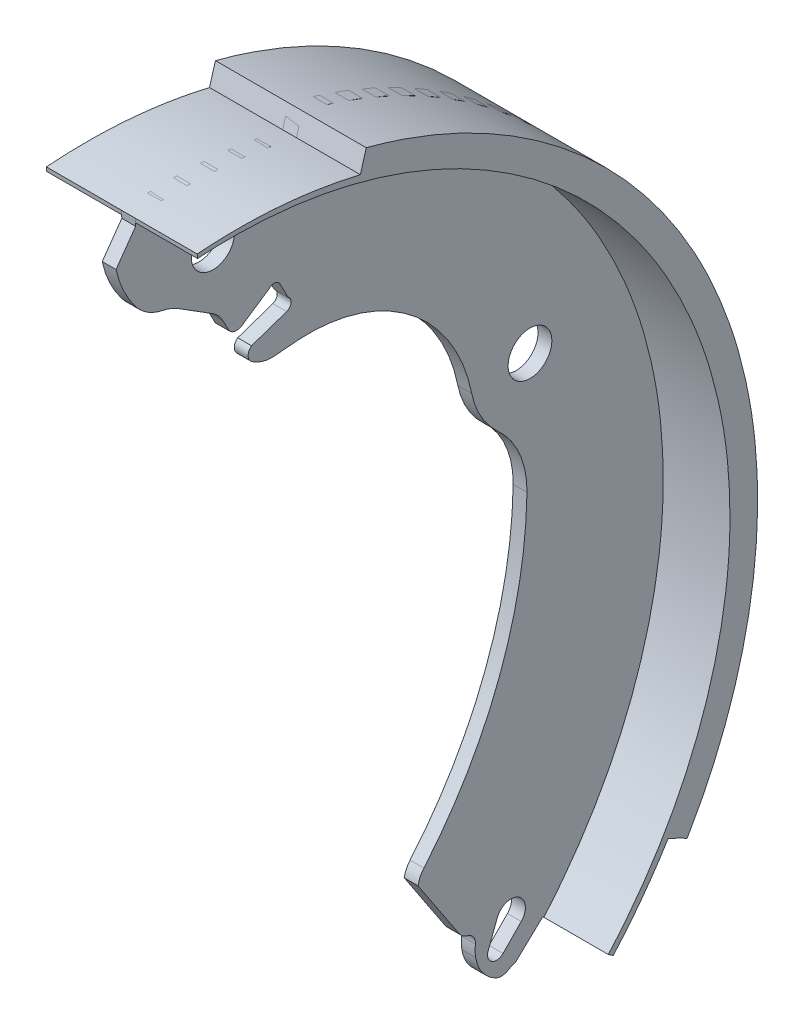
ISO-10303-21;
HEADER;
FILE_DESCRIPTION(('STEP AP214'),'2;1');
FILE_NAME('part.step','',(''),(''),'','','');
FILE_SCHEMA(('AUTOMOTIVE_DESIGN { 1 0 10303 214 1 1 1 1 }'));
ENDSEC;
DATA;
#1=APPLICATION_CONTEXT('core data for automotive mechanical design processes');
#2=APPLICATION_PROTOCOL_DEFINITION('international standard','automotive_design',2000,#1);
#3=PRODUCT_CONTEXT('',#1,'mechanical');
#4=PRODUCT('Part','Part','',(#3));
#5=PRODUCT_RELATED_PRODUCT_CATEGORY('part','',(#4));
#6=PRODUCT_DEFINITION_FORMATION('','',#4);
#7=PRODUCT_DEFINITION_CONTEXT('part definition',#1,'design');
#8=PRODUCT_DEFINITION('design','',#6,#7);
#9=PRODUCT_DEFINITION_SHAPE('','',#8);
#10=(LENGTH_UNIT() NAMED_UNIT(*) SI_UNIT(.MILLI.,.METRE.));
#11=(NAMED_UNIT(*) PLANE_ANGLE_UNIT() SI_UNIT($,.RADIAN.));
#12=(NAMED_UNIT(*) SI_UNIT($,.STERADIAN.) SOLID_ANGLE_UNIT());
#13=UNCERTAINTY_MEASURE_WITH_UNIT(LENGTH_MEASURE(1.E-05),#10,'distance_accuracy_value','');
#14=(GEOMETRIC_REPRESENTATION_CONTEXT(3) GLOBAL_UNCERTAINTY_ASSIGNED_CONTEXT((#13)) GLOBAL_UNIT_ASSIGNED_CONTEXT((#10,
#11,#12)) REPRESENTATION_CONTEXT('',''));
#15=CARTESIAN_POINT('',(0.,0.,0.));
#16=DIRECTION('',(0.,0.,1.));
#17=DIRECTION('',(1.,0.,0.));
#18=AXIS2_PLACEMENT_3D('',#15,#16,#17);
#19=CARTESIAN_POINT('',(2.75,-67.0744511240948,-66.1955785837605));
#20=DIRECTION('',(0.,0.727305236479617,0.686314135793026));
#21=DIRECTION('',(0.,-0.686314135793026,0.727305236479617));
#22=AXIS2_PLACEMENT_3D('',#19,#20,#21);
#23=PLANE('',#22);
#24=DIRECTION('',(0.,0.686314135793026,-0.727305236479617));
#25=VECTOR('',#24,1.);
#26=CARTESIAN_POINT('',(0.,-67.0744511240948,-66.1955785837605));
#27=LINE('',#26,#25);
#28=CARTESIAN_POINT('',(0.,-67.0744511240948,-66.1955785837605));
#29=VERTEX_POINT('',#28);
#30=CARTESIAN_POINT('',(0.,-61.912022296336,-71.6663409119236));
#31=VERTEX_POINT('',#30);
#32=EDGE_CURVE('E276',#29,#31,#27,.T.);
#33=ORIENTED_EDGE('',*,*,#32,.T.);
#34=DIRECTION('',(-1.,0.,0.));
#35=VECTOR('',#34,1.);
#36=CARTESIAN_POINT('',(2.75,-61.912022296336,-71.6663409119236));
#37=LINE('',#36,#35);
#38=CARTESIAN_POINT('',(2.75,-61.912022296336,-71.6663409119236));
#39=VERTEX_POINT('',#38);
#40=EDGE_CURVE('E136',#39,#31,#37,.T.);
#41=ORIENTED_EDGE('',*,*,#40,.F.);
#42=DIRECTION('',(0.,0.686314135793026,-0.727305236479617));
#43=VECTOR('',#42,1.);
#44=CARTESIAN_POINT('',(2.75,-67.0744511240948,-66.1955785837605));
#45=LINE('',#44,#43);
#46=CARTESIAN_POINT('',(2.75,-67.0744511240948,-66.1955785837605));
#47=VERTEX_POINT('',#46);
#48=EDGE_CURVE('E135',#47,#39,#45,.T.);
#49=ORIENTED_EDGE('',*,*,#48,.F.);
#50=DIRECTION('',(-1.,0.,0.));
#51=VECTOR('',#50,1.);
#52=CARTESIAN_POINT('',(2.75,-67.0744511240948,-66.1955785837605));
#53=LINE('',#52,#51);
#54=EDGE_CURVE('E274',#47,#29,#53,.T.);
#55=ORIENTED_EDGE('',*,*,#54,.T.);
#56=EDGE_LOOP('',(#33,#41,#49,#55));
#57=FACE_BOUND('',#56,.T.);
#58=ADVANCED_FACE('F45',(#57),#23,.F.);
#59=CARTESIAN_POINT('',(2.75,1.50601768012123,1.34736909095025));
#60=DIRECTION('',(-1.,0.,0.));
#61=DIRECTION('',(0.,0.,1.));
#62=AXIS2_PLACEMENT_3D('',#59,#60,#61);
#63=CYLINDRICAL_SURFACE('',#62,102.5);
#64=CARTESIAN_POINT('',(0.,1.50601768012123,1.34736909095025));
#65=DIRECTION('',(1.,0.,0.));
#66=DIRECTION('',(0.,0.,-1.));
#67=AXIS2_PLACEMENT_3D('',#64,#65,#66);
#68=CIRCLE('',#67,102.5);
#69=CARTESIAN_POINT('',(0.,-49.7953110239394,-87.3905803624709));
#70=VERTEX_POINT('',#69);
#71=CARTESIAN_POINT('',(0.,100.855665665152,-23.869637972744));
#72=VERTEX_POINT('',#71);
#73=EDGE_CURVE('E320',#70,#72,#68,.T.);
#74=ORIENTED_EDGE('',*,*,#73,.T.);
#75=DIRECTION('',(-1.,0.,0.));
#76=VECTOR('',#75,1.);
#77=CARTESIAN_POINT('',(2.75,100.855665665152,-23.869637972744));
#78=LINE('',#77,#76);
#79=CARTESIAN_POINT('',(2.75,100.855665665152,-23.869637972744));
#80=VERTEX_POINT('',#79);
#81=EDGE_CURVE('E323',#72,#80,#78,.F.);
#82=ORIENTED_EDGE('',*,*,#81,.T.);
#83=CARTESIAN_POINT('',(2.75,1.50601768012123,1.34736909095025));
#84=DIRECTION('',(1.,0.,0.));
#85=DIRECTION('',(0.,0.,-1.));
#86=AXIS2_PLACEMENT_3D('',#83,#84,#85);
#87=CIRCLE('',#86,102.5);
#88=CARTESIAN_POINT('',(2.75,-49.7953110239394,-87.3905803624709));
#89=VERTEX_POINT('',#88);
#90=EDGE_CURVE('E391',#89,#80,#87,.T.);
#91=ORIENTED_EDGE('',*,*,#90,.F.);
#92=DIRECTION('',(-1.,0.,0.));
#93=VECTOR('',#92,1.);
#94=CARTESIAN_POINT('',(2.75,-49.7953110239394,-87.3905803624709));
#95=LINE('',#94,#93);
#96=EDGE_CURVE('E145',#70,#89,#95,.F.);
#97=ORIENTED_EDGE('',*,*,#96,.F.);
#98=EDGE_LOOP('',(#74,#82,#91,#97));
#99=FACE_BOUND('',#98,.T.);
#100=ADVANCED_FACE('F497',(#99),#63,.T.);
#101=CARTESIAN_POINT('',(2.75,71.4719870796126,-10.7959956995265));
#102=DIRECTION('',(-1.,0.,0.));
#103=DIRECTION('',(0.,0.,1.));
#104=AXIS2_PLACEMENT_3D('',#101,#102,#103);
#105=PLANE('',#104);
#106=DIRECTION('',(0.,0.93490868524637,-0.354888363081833));
#107=VECTOR('',#106,1.);
#108=CARTESIAN_POINT('',(2.75,38.0199927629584,-98.9210605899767));
#109=LINE('',#108,#107);
#110=CARTESIAN_POINT('',(2.75,-62.3448890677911,-60.8228706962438));
#111=VERTEX_POINT('',#110);
#112=CARTESIAN_POINT('',(2.75,-57.5062995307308,-62.6595838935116));
#113=VERTEX_POINT('',#112);
#114=EDGE_CURVE('E460',#111,#113,#109,.T.);
#115=ORIENTED_EDGE('',*,*,#114,.T.);
#116=CARTESIAN_POINT('',(2.75,-58.5293531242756,-65.3546897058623));
#117=DIRECTION('',(-1.,0.,0.));
#118=DIRECTION('',(0.,0.,1.));
#119=AXIS2_PLACEMENT_3D('',#116,#117,#118);
#120=CIRCLE('',#119,2.88274764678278);
#121=CARTESIAN_POINT('',(2.75,-60.5472455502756,-67.4134136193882));
#122=VERTEX_POINT('',#121);
#123=EDGE_CURVE('E456',#113,#122,#120,.T.);
#124=ORIENTED_EDGE('',*,*,#123,.T.);
#125=DIRECTION('',(0.,-0.714153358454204,0.699989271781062));
#126=VECTOR('',#125,1.);
#127=CARTESIAN_POINT('',(2.75,-21.5184836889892,-105.668102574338));
#128=LINE('',#127,#126);
#129=CARTESIAN_POINT('',(2.75,-64.2433230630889,-63.7906418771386));
#130=VERTEX_POINT('',#129);
#131=EDGE_CURVE('E459',#122,#130,#128,.T.);
#132=ORIENTED_EDGE('',*,*,#131,.T.);
#133=CARTESIAN_POINT('',(2.75,-62.9835718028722,-62.5053999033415));
#134=DIRECTION('',(-1.,0.,0.));
#135=DIRECTION('',(0.,0.,1.));
#136=AXIS2_PLACEMENT_3D('',#133,#134,#135);
#137=CIRCLE('',#136,1.79967223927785);
#138=EDGE_CURVE('E463',#130,#111,#137,.T.);
#139=ORIENTED_EDGE('',*,*,#138,.T.);
#140=EDGE_LOOP('',(#115,#124,#132,#139));
#141=FACE_BOUND('',#140,.T.);
#142=CARTESIAN_POINT('',(2.75,86.65,-6.1));
#143=DIRECTION('',(-1.,0.,0.));
#144=DIRECTION('',(0.,0.,1.));
#145=AXIS2_PLACEMENT_3D('',#142,#143,#144);
#146=CIRCLE('',#145,4.3);
#147=CARTESIAN_POINT('',(2.75,86.65,-10.4));
#148=VERTEX_POINT('',#147);
#149=EDGE_CURVE('E466',#148,#148,#146,.T.);
#150=ORIENTED_EDGE('',*,*,#149,.T.);
#151=EDGE_LOOP('',(#150));
#152=FACE_BOUND('',#151,.T.);
#153=CARTESIAN_POINT('',(2.75,36.45,-69.15));
#154=DIRECTION('',(-1.,0.,0.));
#155=DIRECTION('',(0.,0.,1.));
#156=AXIS2_PLACEMENT_3D('',#153,#154,#155);
#157=CIRCLE('',#156,4.35000000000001);
#158=CARTESIAN_POINT('',(2.75,36.45,-73.5));
#159=VERTEX_POINT('',#158);
#160=EDGE_CURVE('E471',#159,#159,#157,.T.);
#161=ORIENTED_EDGE('',*,*,#160,.T.);
#162=EDGE_LOOP('',(#161));
#163=FACE_BOUND('',#162,.T.);
#164=CARTESIAN_POINT('',(2.75,-3.09541373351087,0.25917974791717));
#165=DIRECTION('',(-1.,0.,0.));
#166=DIRECTION('',(0.,0.,1.));
#167=AXIS2_PLACEMENT_3D('',#164,#165,#166);
#168=CIRCLE('',#167,102.5);
#169=CARTESIAN_POINT('',(2.75,96.7996129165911,-22.7023892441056));
#170=VERTEX_POINT('',#169);
#171=CARTESIAN_POINT('',(2.75,98.9977240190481,9.38284259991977));
#172=VERTEX_POINT('',#171);
#173=EDGE_CURVE('E474',#170,#172,#168,.F.);
#174=ORIENTED_EDGE('',*,*,#173,.T.);
#175=DIRECTION('',(0.,-0.99721190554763,-0.0746218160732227));
#176=VECTOR('',#175,1.);
#177=CARTESIAN_POINT('',(2.75,70.1236785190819,7.22218476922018));
#178=LINE('',#177,#176);
#179=CARTESIAN_POINT('',(2.75,97.5320019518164,9.27316195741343));
#180=VERTEX_POINT('',#179);
#181=EDGE_CURVE('E390',#172,#180,#178,.T.);
#182=ORIENTED_EDGE('',*,*,#181,.T.);
#183=DIRECTION('',(0.,-0.815072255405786,0.579359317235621));
#184=VECTOR('',#183,1.);
#185=CARTESIAN_POINT('',(2.75,92.0384149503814,13.1780437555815));
#186=LINE('',#185,#184);
#187=CARTESIAN_POINT('',(2.75,92.0384149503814,13.1780437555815));
#188=VERTEX_POINT('',#187);
#189=EDGE_CURVE('E387',#180,#188,#186,.T.);
#190=ORIENTED_EDGE('',*,*,#189,.T.);
#191=CARTESIAN_POINT('',(2.75,96.4280757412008,-7.03246386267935));
#192=DIRECTION('',(1.,0.,0.));
#193=DIRECTION('',(0.,0.,1.));
#194=AXIS2_PLACEMENT_3D('',#191,#192,#193);
#195=CIRCLE('',#194,20.6817247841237);
#196=CARTESIAN_POINT('',(2.75,83.5865868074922,9.1795656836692));
#197=VERTEX_POINT('',#196);
#198=EDGE_CURVE('E384',#188,#197,#195,.T.);
#199=ORIENTED_EDGE('',*,*,#198,.T.);
#200=CARTESIAN_POINT('',(2.75,89.2039592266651,2.08778620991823));
#201=DIRECTION('',(1.,0.,0.));
#202=DIRECTION('',(0.,0.,1.));
#203=AXIS2_PLACEMENT_3D('',#200,#201,#202);
#204=CIRCLE('',#203,9.04699999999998);
#205=CARTESIAN_POINT('',(2.75,80.3267333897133,3.83222607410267));
#206=VERTEX_POINT('',#205);
#207=EDGE_CURVE('E381',#197,#206,#204,.T.);
#208=ORIENTED_EDGE('',*,*,#207,.T.);
#209=CARTESIAN_POINT('',(2.75,71.5299687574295,5.56085472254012));
#210=DIRECTION('',(-1.,0.,0.));
#211=DIRECTION('',(0.,0.,-1.));
#212=AXIS2_PLACEMENT_3D('',#209,#210,#211);
#213=CIRCLE('',#212,8.96499999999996);
#214=CARTESIAN_POINT('',(2.75,79.1229709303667,0.794562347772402));
#215=VERTEX_POINT('',#214);
#216=EDGE_CURVE('E378',#206,#215,#213,.T.);
#217=ORIENTED_EDGE('',*,*,#216,.T.);
#218=DIRECTION('',(0.,-0.531655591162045,-0.846960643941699));
#219=VECTOR('',#218,1.);
#220=CARTESIAN_POINT('',(2.75,74.6993353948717,-6.25256602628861));
#221=LINE('',#220,#219);
#222=CARTESIAN_POINT('',(2.75,74.6993353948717,-6.25256602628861));
#223=VERTEX_POINT('',#222);
#224=EDGE_CURVE('E375',#215,#223,#221,.T.);
#225=ORIENTED_EDGE('',*,*,#224,.T.);
#226=CARTESIAN_POINT('',(2.75,69.7970066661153,-2.71968856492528));
#227=DIRECTION('',(-1.,0.,0.));
#228=DIRECTION('',(0.,0.,-1.));
#229=AXIS2_PLACEMENT_3D('',#226,#227,#228);
#230=CIRCLE('',#229,6.04268567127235);
#231=CARTESIAN_POINT('',(2.75,72.6038024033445,-8.07094522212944));
#232=VERTEX_POINT('',#231);
#233=EDGE_CURVE('E372',#223,#232,#230,.T.);
#234=ORIENTED_EDGE('',*,*,#233,.T.);
#235=DIRECTION('',(0.,-0.885575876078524,-0.464494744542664));
#236=VECTOR('',#235,1.);
#237=CARTESIAN_POINT('',(2.75,70.2581763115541,-9.30125311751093));
#238=LINE('',#237,#236);
#239=CARTESIAN_POINT('',(2.75,70.2581763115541,-9.30125311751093));
#240=VERTEX_POINT('',#239);
#241=EDGE_CURVE('E368',#232,#240,#238,.T.);
#242=ORIENTED_EDGE('',*,*,#241,.T.);
#243=CARTESIAN_POINT('',(2.75,71.4719870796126,-10.7959956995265));
#244=DIRECTION('',(1.,0.,0.));
#245=DIRECTION('',(0.,0.,1.));
#246=AXIS2_PLACEMENT_3D('',#243,#244,#245);
#247=CIRCLE('',#246,1.92551083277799);
#248=CARTESIAN_POINT('',(2.75,69.8735139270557,-11.8695298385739));
#249=VERTEX_POINT('',#248);
#250=EDGE_CURVE('E371',#240,#249,#247,.T.);
#251=ORIENTED_EDGE('',*,*,#250,.T.);
#252=DIRECTION('',(0.,0.557532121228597,-0.830155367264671));
#253=VECTOR('',#252,1.);
#254=CARTESIAN_POINT('',(2.75,73.4974727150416,-17.2655397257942));
#255=LINE('',#254,#253);
#256=CARTESIAN_POINT('',(2.75,73.4974727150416,-17.2655397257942));
#257=VERTEX_POINT('',#256);
#258=EDGE_CURVE('E451',#249,#257,#255,.T.);
#259=ORIENTED_EDGE('',*,*,#258,.T.);
#260=CARTESIAN_POINT('',(2.75,72.6291498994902,-18.2624228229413));
#261=DIRECTION('',(-1.,0.,0.));
#262=DIRECTION('',(0.,0.,-1.));
#263=AXIS2_PLACEMENT_3D('',#260,#261,#262);
#264=CIRCLE('',#263,1.32202890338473);
#265=CARTESIAN_POINT('',(2.75,73.2411448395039,-19.4342686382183));
#266=VERTEX_POINT('',#265);
#267=EDGE_CURVE('E448',#257,#266,#264,.T.);
#268=ORIENTED_EDGE('',*,*,#267,.T.);
#269=DIRECTION('',(0.,-0.886399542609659,-0.462920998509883));
#270=VECTOR('',#269,1.);
#271=CARTESIAN_POINT('',(2.75,70.1387464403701,-21.0544921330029));
#272=LINE('',#271,#270);
#273=CARTESIAN_POINT('',(2.75,70.1387464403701,-21.0544921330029));
#274=VERTEX_POINT('',#273);
#275=EDGE_CURVE('E445',#266,#274,#272,.T.);
#276=ORIENTED_EDGE('',*,*,#275,.T.);
#277=CARTESIAN_POINT('',(2.75,69.0569891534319,-20.3398499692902));
#278=DIRECTION('',(-1.,0.,0.));
#279=DIRECTION('',(0.,0.,-1.));
#280=AXIS2_PLACEMENT_3D('',#277,#278,#279);
#281=CIRCLE('',#280,1.29649999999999);
#282=CARTESIAN_POINT('',(2.75,67.8303896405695,-20.7598093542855));
#283=VERTEX_POINT('',#282);
#284=EDGE_CURVE('E442',#274,#283,#281,.T.);
#285=ORIENTED_EDGE('',*,*,#284,.T.);
#286=DIRECTION('',(0.,-0.323917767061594,0.946085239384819));
#287=VECTOR('',#286,1.);
#288=CARTESIAN_POINT('',(2.75,65.4376749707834,-13.771270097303));
#289=LINE('',#288,#287);
#290=CARTESIAN_POINT('',(2.75,65.4376749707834,-13.771270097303));
#291=VERTEX_POINT('',#290);
#292=EDGE_CURVE('E439',#283,#291,#289,.T.);
#293=ORIENTED_EDGE('',*,*,#292,.T.);
#294=CARTESIAN_POINT('',(2.75,64.0862749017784,-14.7903155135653));
#295=DIRECTION('',(1.,0.,0.));
#296=DIRECTION('',(0.,0.,1.));
#297=AXIS2_PLACEMENT_3D('',#294,#295,#296);
#298=CIRCLE('',#297,1.6925530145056);
#299=CARTESIAN_POINT('',(2.75,62.7348748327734,-13.771270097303));
#300=VERTEX_POINT('',#299);
#301=EDGE_CURVE('E436',#291,#300,#298,.T.);
#302=ORIENTED_EDGE('',*,*,#301,.T.);
#303=CARTESIAN_POINT('',(2.75,68.1442979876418,-17.8503344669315));
#304=DIRECTION('',(1.,0.,0.));
#305=DIRECTION('',(0.,0.,1.));
#306=AXIS2_PLACEMENT_3D('',#303,#304,#305);
#307=CIRCLE('',#306,6.77499999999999);
#308=CARTESIAN_POINT('',(2.75,61.3948863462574,-18.4386094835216));
#309=VERTEX_POINT('',#308);
#310=EDGE_CURVE('E433',#300,#309,#307,.T.);
#311=ORIENTED_EDGE('',*,*,#310,.T.);
#312=DIRECTION('',(0.,0.086830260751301,-0.99622312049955));
#313=VECTOR('',#312,1.);
#314=CARTESIAN_POINT('',(2.75,61.7995153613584,-23.0810092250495));
#315=LINE('',#314,#313);
#316=CARTESIAN_POINT('',(2.75,61.7995153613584,-23.0810092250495));
#317=VERTEX_POINT('',#316);
#318=EDGE_CURVE('E430',#309,#317,#315,.T.);
#319=ORIENTED_EDGE('',*,*,#318,.T.);
#320=CARTESIAN_POINT('',(2.75,28.774430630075,-25.1310780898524));
#321=DIRECTION('',(-1.,0.,0.));
#322=DIRECTION('',(0.,0.,1.));
#323=AXIS2_PLACEMENT_3D('',#320,#321,#322);
#324=CIRCLE('',#323,33.0886537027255);
#325=CARTESIAN_POINT('',(2.75,35.3232597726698,-57.5651934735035));
#326=VERTEX_POINT('',#325);
#327=EDGE_CURVE('E427',#317,#326,#324,.T.);
#328=ORIENTED_EDGE('',*,*,#327,.T.);
#329=CARTESIAN_POINT('',(2.75,38.618226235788,-73.88403767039));
#330=DIRECTION('',(1.,0.,0.));
#331=DIRECTION('',(0.,0.,-1.));
#332=AXIS2_PLACEMENT_3D('',#329,#330,#331);
#333=CIRCLE('',#332,16.6481674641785);
#334=CARTESIAN_POINT('',(2.75,26.422529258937,-62.5514980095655));
#335=VERTEX_POINT('',#334);
#336=EDGE_CURVE('E424',#326,#335,#333,.T.);
#337=ORIENTED_EDGE('',*,*,#336,.T.);
#338=CARTESIAN_POINT('',(2.75,13.0572214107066,-50.6827871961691));
#339=DIRECTION('',(-1.,0.,0.));
#340=DIRECTION('',(0.,0.,1.));
#341=AXIS2_PLACEMENT_3D('',#338,#339,#340);
#342=CIRCLE('',#341,17.8745000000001);
#343=CARTESIAN_POINT('',(2.75,12.8012058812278,-68.5554536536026));
#344=VERTEX_POINT('',#343);
#345=EDGE_CURVE('E421',#335,#344,#342,.T.);
#346=ORIENTED_EDGE('',*,*,#345,.T.);
#347=CARTESIAN_POINT('',(2.75,14.0313368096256,17.3210548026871));
#348=DIRECTION('',(-1.,0.,0.));
#349=DIRECTION('',(0.,0.,1.));
#350=AXIS2_PLACEMENT_3D('',#347,#348,#349);
#351=CIRCLE('',#350,85.8853184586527);
#352=CARTESIAN_POINT('',(2.75,-41.6678046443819,-48.0539677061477));
#353=VERTEX_POINT('',#352);
#354=EDGE_CURVE('E418',#344,#353,#351,.T.);
#355=ORIENTED_EDGE('',*,*,#354,.T.);
#356=CARTESIAN_POINT('',(2.75,-45.0533821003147,-52.0276771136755));
#357=DIRECTION('',(1.,0.,0.));
#358=DIRECTION('',(0.,0.,-1.));
#359=AXIS2_PLACEMENT_3D('',#356,#357,#358);
#360=CIRCLE('',#359,5.2203928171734);
#361=CARTESIAN_POINT('',(2.75,-44.1475236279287,-46.8864786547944));
#362=VERTEX_POINT('',#361);
#363=EDGE_CURVE('E415',#353,#362,#360,.T.);
#364=ORIENTED_EDGE('',*,*,#363,.T.);
#365=DIRECTION('',(0.,-0.833404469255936,-0.552663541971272));
#366=VECTOR('',#365,1.);
#367=CARTESIAN_POINT('',(2.75,-44.1475236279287,-46.8864786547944));
#368=LINE('',#367,#366);
#369=CARTESIAN_POINT('',(2.75,-56.4007491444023,-55.0120782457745));
#370=VERTEX_POINT('',#369);
#371=EDGE_CURVE('E412',#362,#370,#368,.T.);
#372=ORIENTED_EDGE('',*,*,#371,.T.);
#373=CARTESIAN_POINT('',(2.75,-54.6684879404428,-57.6242900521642));
#374=DIRECTION('',(1.,0.,0.));
#375=DIRECTION('',(0.,0.,-1.));
#376=AXIS2_PLACEMENT_3D('',#373,#374,#375);
#377=CIRCLE('',#376,3.13438660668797);
#378=CARTESIAN_POINT('',(2.75,-57.6859841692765,-56.7762948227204));
#379=VERTEX_POINT('',#378);
#380=EDGE_CURVE('E409',#370,#379,#377,.T.);
#381=ORIENTED_EDGE('',*,*,#380,.T.);
#382=CARTESIAN_POINT('',(2.75,-59.6944999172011,-56.2118494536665));
#383=DIRECTION('',(-1.,0.,0.));
#384=DIRECTION('',(0.,0.,1.));
#385=AXIS2_PLACEMENT_3D('',#382,#383,#384);
#386=CIRCLE('',#385,2.08632070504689);
#387=CARTESIAN_POINT('',(2.75,-59.9019211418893,-58.2878336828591));
#388=VERTEX_POINT('',#387);
#389=EDGE_CURVE('E406',#379,#388,#386,.T.);
#390=ORIENTED_EDGE('',*,*,#389,.T.);
#391=CARTESIAN_POINT('',(2.75,-60.8138545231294,-67.4149580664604));
#392=DIRECTION('',(1.,0.,0.));
#393=DIRECTION('',(0.,0.,-1.));
#394=AXIS2_PLACEMENT_3D('',#391,#392,#393);
#395=CIRCLE('',#394,9.17256899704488);
#396=CARTESIAN_POINT('',(2.75,-62.2377973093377,-58.3535890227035));
#397=VERTEX_POINT('',#396);
#398=EDGE_CURVE('E403',#388,#397,#395,.T.);
#399=ORIENTED_EDGE('',*,*,#398,.T.);
#400=CARTESIAN_POINT('',(2.75,-61.0731992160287,-65.7645982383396));
#401=DIRECTION('',(1.,0.,0.));
#402=DIRECTION('',(0.,0.,-1.));
#403=AXIS2_PLACEMENT_3D('',#400,#401,#402);
#404=CIRCLE('',#403,7.50195616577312);
#405=CARTESIAN_POINT('',(2.75,-67.729716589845,-62.3048117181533));
#406=VERTEX_POINT('',#405);
#407=EDGE_CURVE('E400',#397,#406,#404,.T.);
#408=ORIENTED_EDGE('',*,*,#407,.T.);
#409=CARTESIAN_POINT('',(2.75,-65.49954557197,-63.4639637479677));
#410=DIRECTION('',(1.,0.,0.));
#411=DIRECTION('',(0.,0.,-1.));
#412=AXIS2_PLACEMENT_3D('',#409,#410,#411);
#413=CIRCLE('',#412,2.513423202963);
#414=CARTESIAN_POINT('',(2.75,-67.6784143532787,-64.7168911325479));
#415=VERTEX_POINT('',#414);
#416=EDGE_CURVE('E397',#406,#415,#413,.T.);
#417=ORIENTED_EDGE('',*,*,#416,.T.);
#418=CARTESIAN_POINT('',(2.75,-72.8569099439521,-67.6947110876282));
#419=DIRECTION('',(-1.,0.,0.));
#420=DIRECTION('',(0.,0.,1.));
#421=AXIS2_PLACEMENT_3D('',#418,#419,#420);
#422=CIRCLE('',#421,5.97362773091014);
#423=EDGE_CURVE('E395',#415,#47,#422,.T.);
#424=ORIENTED_EDGE('',*,*,#423,.T.);
#425=ORIENTED_EDGE('',*,*,#48,.T.);
#426=DIRECTION('',(0.,0.561006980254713,0.827811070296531));
#427=VECTOR('',#426,1.);
#428=CARTESIAN_POINT('',(2.75,8.33643358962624,31.9909245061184));
#429=LINE('',#428,#427);
#430=CARTESIAN_POINT('',(2.75,-62.7415139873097,-72.8903228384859));
#431=VERTEX_POINT('',#430);
#432=EDGE_CURVE('E125',#431,#39,#429,.T.);
#433=ORIENTED_EDGE('',*,*,#432,.F.);
#434=CARTESIAN_POINT('',(2.75,4.55031306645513,4.42759236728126));
#435=DIRECTION('',(-1.,0.,0.));
#436=DIRECTION('',(0.,0.,1.));
#437=AXIS2_PLACEMENT_3D('',#434,#435,#436);
#438=CIRCLE('',#437,102.5);
#439=CARTESIAN_POINT('',(2.75,-47.9172820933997,-83.6258088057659));
#440=VERTEX_POINT('',#439);
#441=EDGE_CURVE('E110',#440,#431,#438,.T.);
#442=ORIENTED_EDGE('',*,*,#441,.F.);
#443=DIRECTION('',(0.,0.405704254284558,0.914004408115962));
#444=VECTOR('',#443,1.);
#445=CARTESIAN_POINT('',(2.75,-1.25987100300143,21.4879013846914));
#446=LINE('',#445,#444);
#447=CARTESIAN_POINT('',(2.75,-49.1343948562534,-86.3678220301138));
#448=VERTEX_POINT('',#447);
#449=EDGE_CURVE('E142',#448,#440,#446,.T.);
#450=ORIENTED_EDGE('',*,*,#449,.F.);
#451=DIRECTION('',(0.,0.542748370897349,0.839895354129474));
#452=VECTOR('',#451,1.);
#453=CARTESIAN_POINT('',(2.75,20.8428815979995,21.9210140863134));
#454=LINE('',#453,#452);
#455=EDGE_CURVE('E146',#89,#448,#454,.T.);
#456=ORIENTED_EDGE('',*,*,#455,.F.);
#457=ORIENTED_EDGE('',*,*,#90,.T.);
#458=DIRECTION('',(0.,-0.960997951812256,0.276555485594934));
#459=VECTOR('',#458,1.);
#460=CARTESIAN_POINT('',(2.75,70.244764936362,-15.0604490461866));
#461=LINE('',#460,#459);
#462=EDGE_CURVE('E64',#80,#170,#461,.T.);
#463=ORIENTED_EDGE('',*,*,#462,.T.);
#464=EDGE_LOOP('',(#174,#182,#190,#199,#208,#217,#225,#234,#242,#251,#259,#268,#276,#285,#293,
#302,#311,#319,#328,#337,#346,#355,#364,#372,#381,#390,#399,#408,#417,#424,#425,#433,#442,#450,
#456,#457,#463));
#465=FACE_BOUND('',#464,.T.);
#466=ADVANCED_FACE('F132',(#141,#152,#163,#465),#105,.F.);
#467=CARTESIAN_POINT('',(0.,71.4719870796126,-10.7959956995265));
#468=DIRECTION('',(-1.,0.,0.));
#469=DIRECTION('',(0.,0.,1.));
#470=AXIS2_PLACEMENT_3D('',#467,#468,#469);
#471=PLANE('',#470);
#472=DIRECTION('',(0.,-0.99721190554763,-0.0746218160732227));
#473=VECTOR('',#472,1.);
#474=CARTESIAN_POINT('',(0.,70.1236785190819,7.22218476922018));
#475=LINE('',#474,#473);
#476=CARTESIAN_POINT('',(0.,98.9977240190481,9.38284259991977));
#477=VERTEX_POINT('',#476);
#478=CARTESIAN_POINT('',(0.,97.5320019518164,9.27316195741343));
#479=VERTEX_POINT('',#478);
#480=EDGE_CURVE('E149',#477,#479,#475,.T.);
#481=ORIENTED_EDGE('',*,*,#480,.F.);
#482=CARTESIAN_POINT('',(0.,-3.09541373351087,0.25917974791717));
#483=DIRECTION('',(-1.,0.,0.));
#484=DIRECTION('',(0.,0.,1.));
#485=AXIS2_PLACEMENT_3D('',#482,#483,#484);
#486=CIRCLE('',#485,102.5);
#487=CARTESIAN_POINT('',(0.,96.7996129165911,-22.7023892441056));
#488=VERTEX_POINT('',#487);
#489=EDGE_CURVE('E55',#488,#477,#486,.F.);
#490=ORIENTED_EDGE('',*,*,#489,.F.);
#491=DIRECTION('',(0.,-0.960997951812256,0.276555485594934));
#492=VECTOR('',#491,1.);
#493=CARTESIAN_POINT('',(0.,70.244764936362,-15.0604490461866));
#494=LINE('',#493,#492);
#495=EDGE_CURVE('E12',#72,#488,#494,.T.);
#496=ORIENTED_EDGE('',*,*,#495,.F.);
#497=ORIENTED_EDGE('',*,*,#73,.F.);
#498=DIRECTION('',(0.,0.542748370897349,0.839895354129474));
#499=VECTOR('',#498,1.);
#500=CARTESIAN_POINT('',(0.,20.8428815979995,21.9210140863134));
#501=LINE('',#500,#499);
#502=CARTESIAN_POINT('',(0.,-49.1343948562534,-86.3678220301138));
#503=VERTEX_POINT('',#502);
#504=EDGE_CURVE('E160',#70,#503,#501,.T.);
#505=ORIENTED_EDGE('',*,*,#504,.T.);
#506=DIRECTION('',(0.,0.405704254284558,0.914004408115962));
#507=VECTOR('',#506,1.);
#508=CARTESIAN_POINT('',(0.,-1.25987100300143,21.4879013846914));
#509=LINE('',#508,#507);
#510=CARTESIAN_POINT('',(0.,-47.9172820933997,-83.6258088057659));
#511=VERTEX_POINT('',#510);
#512=EDGE_CURVE('E163',#503,#511,#509,.T.);
#513=ORIENTED_EDGE('',*,*,#512,.T.);
#514=CARTESIAN_POINT('',(0.,4.55031306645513,4.42759236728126));
#515=DIRECTION('',(-1.,0.,0.));
#516=DIRECTION('',(0.,0.,1.));
#517=AXIS2_PLACEMENT_3D('',#514,#515,#516);
#518=CIRCLE('',#517,102.5);
#519=CARTESIAN_POINT('',(0.,-62.7415139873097,-72.8903228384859));
#520=VERTEX_POINT('',#519);
#521=EDGE_CURVE('E166',#511,#520,#518,.T.);
#522=ORIENTED_EDGE('',*,*,#521,.T.);
#523=DIRECTION('',(0.,0.561006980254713,0.827811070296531));
#524=VECTOR('',#523,1.);
#525=CARTESIAN_POINT('',(0.,8.33643358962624,31.9909245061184));
#526=LINE('',#525,#524);
#527=EDGE_CURVE('E128',#520,#31,#526,.T.);
#528=ORIENTED_EDGE('',*,*,#527,.T.);
#529=ORIENTED_EDGE('',*,*,#32,.F.);
#530=CARTESIAN_POINT('',(0.,-72.8569099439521,-67.6947110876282));
#531=DIRECTION('',(-1.,0.,0.));
#532=DIRECTION('',(0.,0.,1.));
#533=AXIS2_PLACEMENT_3D('',#530,#531,#532);
#534=CIRCLE('',#533,5.97362773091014);
#535=CARTESIAN_POINT('',(0.,-67.6784143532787,-64.7168911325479));
#536=VERTEX_POINT('',#535);
#537=EDGE_CURVE('E269',#536,#29,#534,.T.);
#538=ORIENTED_EDGE('',*,*,#537,.F.);
#539=CARTESIAN_POINT('',(0.,-65.49954557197,-63.4639637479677));
#540=DIRECTION('',(1.,0.,0.));
#541=DIRECTION('',(0.,0.,-1.));
#542=AXIS2_PLACEMENT_3D('',#539,#540,#541);
#543=CIRCLE('',#542,2.513423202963);
#544=CARTESIAN_POINT('',(0.,-67.729716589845,-62.3048117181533));
#545=VERTEX_POINT('',#544);
#546=EDGE_CURVE('E265',#545,#536,#543,.T.);
#547=ORIENTED_EDGE('',*,*,#546,.F.);
#548=CARTESIAN_POINT('',(0.,-61.0731992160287,-65.7645982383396));
#549=DIRECTION('',(1.,0.,0.));
#550=DIRECTION('',(0.,0.,-1.));
#551=AXIS2_PLACEMENT_3D('',#548,#549,#550);
#552=CIRCLE('',#551,7.50195616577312);
#553=CARTESIAN_POINT('',(0.,-62.2377973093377,-58.3535890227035));
#554=VERTEX_POINT('',#553);
#555=EDGE_CURVE('E261',#554,#545,#552,.T.);
#556=ORIENTED_EDGE('',*,*,#555,.F.);
#557=CARTESIAN_POINT('',(0.,-60.8138545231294,-67.4149580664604));
#558=DIRECTION('',(1.,0.,0.));
#559=DIRECTION('',(0.,0.,-1.));
#560=AXIS2_PLACEMENT_3D('',#557,#558,#559);
#561=CIRCLE('',#560,9.17256899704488);
#562=CARTESIAN_POINT('',(0.,-59.9019211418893,-58.2878336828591));
#563=VERTEX_POINT('',#562);
#564=EDGE_CURVE('E257',#563,#554,#561,.T.);
#565=ORIENTED_EDGE('',*,*,#564,.F.);
#566=CARTESIAN_POINT('',(0.,-59.6944999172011,-56.2118494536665));
#567=DIRECTION('',(-1.,0.,0.));
#568=DIRECTION('',(0.,0.,1.));
#569=AXIS2_PLACEMENT_3D('',#566,#567,#568);
#570=CIRCLE('',#569,2.08632070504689);
#571=CARTESIAN_POINT('',(0.,-57.6859841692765,-56.7762948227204));
#572=VERTEX_POINT('',#571);
#573=EDGE_CURVE('E253',#572,#563,#570,.T.);
#574=ORIENTED_EDGE('',*,*,#573,.F.);
#575=CARTESIAN_POINT('',(0.,-54.6684879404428,-57.6242900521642));
#576=DIRECTION('',(1.,0.,0.));
#577=DIRECTION('',(0.,0.,-1.));
#578=AXIS2_PLACEMENT_3D('',#575,#576,#577);
#579=CIRCLE('',#578,3.13438660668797);
#580=CARTESIAN_POINT('',(0.,-56.4007491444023,-55.0120782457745));
#581=VERTEX_POINT('',#580);
#582=EDGE_CURVE('E249',#581,#572,#579,.T.);
#583=ORIENTED_EDGE('',*,*,#582,.F.);
#584=DIRECTION('',(0.,-0.833404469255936,-0.552663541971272));
#585=VECTOR('',#584,1.);
#586=CARTESIAN_POINT('',(0.,-44.1475236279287,-46.8864786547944));
#587=LINE('',#586,#585);
#588=CARTESIAN_POINT('',(0.,-44.1475236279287,-46.8864786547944));
#589=VERTEX_POINT('',#588);
#590=EDGE_CURVE('E245',#589,#581,#587,.T.);
#591=ORIENTED_EDGE('',*,*,#590,.F.);
#592=CARTESIAN_POINT('',(0.,-45.0533821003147,-52.0276771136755));
#593=DIRECTION('',(1.,0.,0.));
#594=DIRECTION('',(0.,0.,-1.));
#595=AXIS2_PLACEMENT_3D('',#592,#593,#594);
#596=CIRCLE('',#595,5.2203928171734);
#597=CARTESIAN_POINT('',(0.,-41.6678046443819,-48.0539677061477));
#598=VERTEX_POINT('',#597);
#599=EDGE_CURVE('E241',#598,#589,#596,.T.);
#600=ORIENTED_EDGE('',*,*,#599,.F.);
#601=CARTESIAN_POINT('',(0.,14.0313368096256,17.3210548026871));
#602=DIRECTION('',(-1.,0.,0.));
#603=DIRECTION('',(0.,0.,1.));
#604=AXIS2_PLACEMENT_3D('',#601,#602,#603);
#605=CIRCLE('',#604,85.8853184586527);
#606=CARTESIAN_POINT('',(0.,12.8012058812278,-68.5554536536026));
#607=VERTEX_POINT('',#606);
#608=EDGE_CURVE('E237',#607,#598,#605,.T.);
#609=ORIENTED_EDGE('',*,*,#608,.F.);
#610=CARTESIAN_POINT('',(0.,13.0572214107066,-50.6827871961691));
#611=DIRECTION('',(-1.,0.,0.));
#612=DIRECTION('',(0.,0.,1.));
#613=AXIS2_PLACEMENT_3D('',#610,#611,#612);
#614=CIRCLE('',#613,17.8745000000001);
#615=CARTESIAN_POINT('',(0.,26.422529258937,-62.5514980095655));
#616=VERTEX_POINT('',#615);
#617=EDGE_CURVE('E233',#616,#607,#614,.T.);
#618=ORIENTED_EDGE('',*,*,#617,.F.);
#619=CARTESIAN_POINT('',(0.,38.618226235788,-73.88403767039));
#620=DIRECTION('',(1.,0.,0.));
#621=DIRECTION('',(0.,0.,-1.));
#622=AXIS2_PLACEMENT_3D('',#619,#620,#621);
#623=CIRCLE('',#622,16.6481674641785);
#624=CARTESIAN_POINT('',(0.,35.3232597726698,-57.5651934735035));
#625=VERTEX_POINT('',#624);
#626=EDGE_CURVE('E229',#625,#616,#623,.T.);
#627=ORIENTED_EDGE('',*,*,#626,.F.);
#628=CARTESIAN_POINT('',(0.,28.774430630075,-25.1310780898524));
#629=DIRECTION('',(-1.,0.,0.));
#630=DIRECTION('',(0.,0.,1.));
#631=AXIS2_PLACEMENT_3D('',#628,#629,#630);
#632=CIRCLE('',#631,33.0886537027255);
#633=CARTESIAN_POINT('',(0.,61.7995153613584,-23.0810092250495));
#634=VERTEX_POINT('',#633);
#635=EDGE_CURVE('E225',#634,#625,#632,.T.);
#636=ORIENTED_EDGE('',*,*,#635,.F.);
#637=DIRECTION('',(0.,0.086830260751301,-0.99622312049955));
#638=VECTOR('',#637,1.);
#639=CARTESIAN_POINT('',(0.,61.7995153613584,-23.0810092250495));
#640=LINE('',#639,#638);
#641=CARTESIAN_POINT('',(0.,61.3948863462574,-18.4386094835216));
#642=VERTEX_POINT('',#641);
#643=EDGE_CURVE('E221',#642,#634,#640,.T.);
#644=ORIENTED_EDGE('',*,*,#643,.F.);
#645=CARTESIAN_POINT('',(0.,68.1442979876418,-17.8503344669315));
#646=DIRECTION('',(1.,0.,0.));
#647=DIRECTION('',(0.,0.,1.));
#648=AXIS2_PLACEMENT_3D('',#645,#646,#647);
#649=CIRCLE('',#648,6.77499999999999);
#650=CARTESIAN_POINT('',(0.,62.7348748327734,-13.771270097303));
#651=VERTEX_POINT('',#650);
#652=EDGE_CURVE('E217',#651,#642,#649,.T.);
#653=ORIENTED_EDGE('',*,*,#652,.F.);
#654=CARTESIAN_POINT('',(0.,64.0862749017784,-14.7903155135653));
#655=DIRECTION('',(1.,0.,0.));
#656=DIRECTION('',(0.,0.,1.));
#657=AXIS2_PLACEMENT_3D('',#654,#655,#656);
#658=CIRCLE('',#657,1.6925530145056);
#659=CARTESIAN_POINT('',(0.,65.4376749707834,-13.771270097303));
#660=VERTEX_POINT('',#659);
#661=EDGE_CURVE('E213',#660,#651,#658,.T.);
#662=ORIENTED_EDGE('',*,*,#661,.F.);
#663=DIRECTION('',(0.,-0.323917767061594,0.946085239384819));
#664=VECTOR('',#663,1.);
#665=CARTESIAN_POINT('',(0.,65.4376749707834,-13.771270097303));
#666=LINE('',#665,#664);
#667=CARTESIAN_POINT('',(0.,67.8303896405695,-20.7598093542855));
#668=VERTEX_POINT('',#667);
#669=EDGE_CURVE('E209',#668,#660,#666,.T.);
#670=ORIENTED_EDGE('',*,*,#669,.F.);
#671=CARTESIAN_POINT('',(0.,69.0569891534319,-20.3398499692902));
#672=DIRECTION('',(-1.,0.,0.));
#673=DIRECTION('',(0.,0.,-1.));
#674=AXIS2_PLACEMENT_3D('',#671,#672,#673);
#675=CIRCLE('',#674,1.29649999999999);
#676=CARTESIAN_POINT('',(0.,70.1387464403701,-21.0544921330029));
#677=VERTEX_POINT('',#676);
#678=EDGE_CURVE('E205',#677,#668,#675,.T.);
#679=ORIENTED_EDGE('',*,*,#678,.F.);
#680=DIRECTION('',(0.,-0.886399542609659,-0.462920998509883));
#681=VECTOR('',#680,1.);
#682=CARTESIAN_POINT('',(0.,70.1387464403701,-21.0544921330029));
#683=LINE('',#682,#681);
#684=CARTESIAN_POINT('',(0.,73.2411448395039,-19.4342686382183));
#685=VERTEX_POINT('',#684);
#686=EDGE_CURVE('E201',#685,#677,#683,.T.);
#687=ORIENTED_EDGE('',*,*,#686,.F.);
#688=CARTESIAN_POINT('',(0.,72.6291498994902,-18.2624228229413));
#689=DIRECTION('',(-1.,0.,0.));
#690=DIRECTION('',(0.,0.,-1.));
#691=AXIS2_PLACEMENT_3D('',#688,#689,#690);
#692=CIRCLE('',#691,1.32202890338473);
#693=CARTESIAN_POINT('',(0.,73.4974727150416,-17.2655397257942));
#694=VERTEX_POINT('',#693);
#695=EDGE_CURVE('E196',#694,#685,#692,.T.);
#696=ORIENTED_EDGE('',*,*,#695,.F.);
#697=DIRECTION('',(0.,0.557532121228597,-0.830155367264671));
#698=VECTOR('',#697,1.);
#699=CARTESIAN_POINT('',(0.,73.4974727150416,-17.2655397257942));
#700=LINE('',#699,#698);
#701=CARTESIAN_POINT('',(0.,69.8735139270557,-11.8695298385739));
#702=VERTEX_POINT('',#701);
#703=EDGE_CURVE('E197',#702,#694,#700,.T.);
#704=ORIENTED_EDGE('',*,*,#703,.F.);
#705=CARTESIAN_POINT('',(0.,71.4719870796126,-10.7959956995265));
#706=DIRECTION('',(1.,0.,0.));
#707=DIRECTION('',(0.,0.,1.));
#708=AXIS2_PLACEMENT_3D('',#705,#706,#707);
#709=CIRCLE('',#708,1.92551083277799);
#710=CARTESIAN_POINT('',(0.,70.2581763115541,-9.30125311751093));
#711=VERTEX_POINT('',#710);
#712=EDGE_CURVE('E169',#711,#702,#709,.T.);
#713=ORIENTED_EDGE('',*,*,#712,.F.);
#714=DIRECTION('',(0.,-0.885575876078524,-0.464494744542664));
#715=VECTOR('',#714,1.);
#716=CARTESIAN_POINT('',(0.,70.2581763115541,-9.30125311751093));
#717=LINE('',#716,#715);
#718=CARTESIAN_POINT('',(0.,72.6038024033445,-8.07094522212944));
#719=VERTEX_POINT('',#718);
#720=EDGE_CURVE('E300',#719,#711,#717,.T.);
#721=ORIENTED_EDGE('',*,*,#720,.F.);
#722=CARTESIAN_POINT('',(0.,69.7970066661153,-2.71968856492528));
#723=DIRECTION('',(-1.,0.,0.));
#724=DIRECTION('',(0.,0.,-1.));
#725=AXIS2_PLACEMENT_3D('',#722,#723,#724);
#726=CIRCLE('',#725,6.04268567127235);
#727=CARTESIAN_POINT('',(0.,74.6993353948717,-6.25256602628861));
#728=VERTEX_POINT('',#727);
#729=EDGE_CURVE('E296',#728,#719,#726,.T.);
#730=ORIENTED_EDGE('',*,*,#729,.F.);
#731=DIRECTION('',(0.,-0.531655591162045,-0.846960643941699));
#732=VECTOR('',#731,1.);
#733=CARTESIAN_POINT('',(0.,74.6993353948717,-6.25256602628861));
#734=LINE('',#733,#732);
#735=CARTESIAN_POINT('',(0.,79.1229709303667,0.794562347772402));
#736=VERTEX_POINT('',#735);
#737=EDGE_CURVE('E292',#736,#728,#734,.T.);
#738=ORIENTED_EDGE('',*,*,#737,.F.);
#739=CARTESIAN_POINT('',(0.,71.5299687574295,5.56085472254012));
#740=DIRECTION('',(-1.,0.,0.));
#741=DIRECTION('',(0.,0.,-1.));
#742=AXIS2_PLACEMENT_3D('',#739,#740,#741);
#743=CIRCLE('',#742,8.96499999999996);
#744=CARTESIAN_POINT('',(0.,80.3267333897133,3.83222607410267));
#745=VERTEX_POINT('',#744);
#746=EDGE_CURVE('E288',#745,#736,#743,.T.);
#747=ORIENTED_EDGE('',*,*,#746,.F.);
#748=CARTESIAN_POINT('',(0.,89.2039592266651,2.08778620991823));
#749=DIRECTION('',(1.,0.,0.));
#750=DIRECTION('',(0.,0.,1.));
#751=AXIS2_PLACEMENT_3D('',#748,#749,#750);
#752=CIRCLE('',#751,9.04699999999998);
#753=CARTESIAN_POINT('',(0.,83.5865868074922,9.1795656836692));
#754=VERTEX_POINT('',#753);
#755=EDGE_CURVE('E284',#754,#745,#752,.T.);
#756=ORIENTED_EDGE('',*,*,#755,.F.);
#757=CARTESIAN_POINT('',(0.,96.4280757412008,-7.03246386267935));
#758=DIRECTION('',(1.,0.,0.));
#759=DIRECTION('',(0.,0.,1.));
#760=AXIS2_PLACEMENT_3D('',#757,#758,#759);
#761=CIRCLE('',#760,20.6817247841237);
#762=CARTESIAN_POINT('',(0.,92.0384149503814,13.1780437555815));
#763=VERTEX_POINT('',#762);
#764=EDGE_CURVE('E280',#763,#754,#761,.T.);
#765=ORIENTED_EDGE('',*,*,#764,.F.);
#766=DIRECTION('',(0.,-0.815072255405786,0.579359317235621));
#767=VECTOR('',#766,1.);
#768=CARTESIAN_POINT('',(0.,92.0384149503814,13.1780437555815));
#769=LINE('',#768,#767);
#770=EDGE_CURVE('E273',#479,#763,#769,.T.);
#771=ORIENTED_EDGE('',*,*,#770,.F.);
#772=EDGE_LOOP('',(#481,#490,#496,#497,#505,#513,#522,#528,#529,#538,#547,#556,#565,#574,#583,
#591,#600,#609,#618,#627,#636,#644,#653,#662,#670,#679,#687,#696,#704,#713,#721,#730,#738,#747,
#756,#765,#771));
#773=FACE_BOUND('',#772,.T.);
#774=CARTESIAN_POINT('',(0.,-58.5293531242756,-65.3546897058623));
#775=DIRECTION('',(-1.,0.,0.));
#776=DIRECTION('',(0.,0.,1.));
#777=AXIS2_PLACEMENT_3D('',#774,#775,#776);
#778=CIRCLE('',#777,2.88274764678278);
#779=CARTESIAN_POINT('',(0.,-57.5062995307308,-62.6595838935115));
#780=VERTEX_POINT('',#779);
#781=CARTESIAN_POINT('',(0.,-60.5472455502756,-67.4134136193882));
#782=VERTEX_POINT('',#781);
#783=EDGE_CURVE('E170',#780,#782,#778,.T.);
#784=ORIENTED_EDGE('',*,*,#783,.F.);
#785=DIRECTION('',(0.,0.93490868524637,-0.354888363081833));
#786=VECTOR('',#785,1.);
#787=CARTESIAN_POINT('',(0.,38.0199927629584,-98.9210605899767));
#788=LINE('',#787,#786);
#789=CARTESIAN_POINT('',(0.,-62.3448890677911,-60.8228706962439));
#790=VERTEX_POINT('',#789);
#791=EDGE_CURVE('E183',#790,#780,#788,.T.);
#792=ORIENTED_EDGE('',*,*,#791,.F.);
#793=CARTESIAN_POINT('',(0.,-62.9835718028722,-62.5053999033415));
#794=DIRECTION('',(-1.,0.,0.));
#795=DIRECTION('',(0.,0.,1.));
#796=AXIS2_PLACEMENT_3D('',#793,#794,#795);
#797=CIRCLE('',#796,1.79967223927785);
#798=CARTESIAN_POINT('',(0.,-64.2433230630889,-63.7906418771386));
#799=VERTEX_POINT('',#798);
#800=EDGE_CURVE('E179',#799,#790,#797,.T.);
#801=ORIENTED_EDGE('',*,*,#800,.F.);
#802=DIRECTION('',(0.,-0.714153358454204,0.699989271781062));
#803=VECTOR('',#802,1.);
#804=CARTESIAN_POINT('',(0.,-21.5184836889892,-105.668102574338));
#805=LINE('',#804,#803);
#806=EDGE_CURVE('E175',#782,#799,#805,.T.);
#807=ORIENTED_EDGE('',*,*,#806,.F.);
#808=EDGE_LOOP('',(#784,#792,#801,#807));
#809=FACE_BOUND('',#808,.T.);
#810=CARTESIAN_POINT('',(0.,86.65,-6.1));
#811=DIRECTION('',(-1.,0.,0.));
#812=DIRECTION('',(0.,0.,1.));
#813=AXIS2_PLACEMENT_3D('',#810,#811,#812);
#814=CIRCLE('',#813,4.3);
#815=CARTESIAN_POINT('',(0.,86.65,-10.4));
#816=VERTEX_POINT('',#815);
#817=EDGE_CURVE('E174',#816,#816,#814,.T.);
#818=ORIENTED_EDGE('',*,*,#817,.F.);
#819=EDGE_LOOP('',(#818));
#820=FACE_BOUND('',#819,.T.);
#821=CARTESIAN_POINT('',(0.,36.45,-69.15));
#822=DIRECTION('',(-1.,0.,0.));
#823=DIRECTION('',(0.,0.,1.));
#824=AXIS2_PLACEMENT_3D('',#821,#822,#823);
#825=CIRCLE('',#824,4.35000000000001);
#826=CARTESIAN_POINT('',(0.,36.45,-73.5));
#827=VERTEX_POINT('',#826);
#828=EDGE_CURVE('E189',#827,#827,#825,.T.);
#829=ORIENTED_EDGE('',*,*,#828,.F.);
#830=EDGE_LOOP('',(#829));
#831=FACE_BOUND('',#830,.T.);
#832=ADVANCED_FACE('F47',(#773,#809,#820,#831),#471,.T.);
#833=CARTESIAN_POINT('',(2.75,71.4719870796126,-10.7959956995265));
#834=DIRECTION('',(-1.,0.,0.));
#835=DIRECTION('',(0.,0.,1.));
#836=AXIS2_PLACEMENT_3D('',#833,#834,#835);
#837=CYLINDRICAL_SURFACE('',#836,1.92551083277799);
#838=ORIENTED_EDGE('',*,*,#712,.T.);
#839=DIRECTION('',(-1.,0.,0.));
#840=VECTOR('',#839,1.);
#841=CARTESIAN_POINT('',(2.75,69.8735139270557,-11.8695298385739));
#842=LINE('',#841,#840);
#843=EDGE_CURVE('E193',#249,#702,#842,.T.);
#844=ORIENTED_EDGE('',*,*,#843,.F.);
#845=ORIENTED_EDGE('',*,*,#250,.F.);
#846=DIRECTION('',(-1.,0.,0.));
#847=VECTOR('',#846,1.);
#848=CARTESIAN_POINT('',(2.75,70.2581763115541,-9.30125311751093));
#849=LINE('',#848,#847);
#850=EDGE_CURVE('E303',#240,#711,#849,.T.);
#851=ORIENTED_EDGE('',*,*,#850,.T.);
#852=EDGE_LOOP('',(#838,#844,#845,#851));
#853=FACE_BOUND('',#852,.T.);
#854=ADVANCED_FACE('F681',(#853),#837,.T.);
#855=CARTESIAN_POINT('',(2.75,73.4974727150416,-17.2655397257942));
#856=DIRECTION('',(0.,0.830155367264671,0.557532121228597));
#857=DIRECTION('',(0.,-0.557532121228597,0.830155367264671));
#858=AXIS2_PLACEMENT_3D('',#855,#856,#857);
#859=PLANE('',#858);
#860=ORIENTED_EDGE('',*,*,#703,.T.);
#861=DIRECTION('',(-1.,0.,0.));
#862=VECTOR('',#861,1.);
#863=CARTESIAN_POINT('',(2.75,73.4974727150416,-17.2655397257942));
#864=LINE('',#863,#862);
#865=EDGE_CURVE('E198',#257,#694,#864,.T.);
#866=ORIENTED_EDGE('',*,*,#865,.F.);
#867=ORIENTED_EDGE('',*,*,#258,.F.);
#868=ORIENTED_EDGE('',*,*,#843,.T.);
#869=EDGE_LOOP('',(#860,#866,#867,#868));
#870=FACE_BOUND('',#869,.T.);
#871=ADVANCED_FACE('F683',(#870),#859,.F.);
#872=CARTESIAN_POINT('',(2.75,72.6291498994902,-18.2624228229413));
#873=DIRECTION('',(-1.,0.,0.));
#874=DIRECTION('',(0.,0.,1.));
#875=AXIS2_PLACEMENT_3D('',#872,#873,#874);
#876=CYLINDRICAL_SURFACE('',#875,1.32202890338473);
#877=ORIENTED_EDGE('',*,*,#695,.T.);
#878=DIRECTION('',(-1.,0.,0.));
#879=VECTOR('',#878,1.);
#880=CARTESIAN_POINT('',(2.75,73.2411448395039,-19.4342686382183));
#881=LINE('',#880,#879);
#882=EDGE_CURVE('E202',#266,#685,#881,.T.);
#883=ORIENTED_EDGE('',*,*,#882,.F.);
#884=ORIENTED_EDGE('',*,*,#267,.F.);
#885=ORIENTED_EDGE('',*,*,#865,.T.);
#886=EDGE_LOOP('',(#877,#883,#884,#885));
#887=FACE_BOUND('',#886,.T.);
#888=ADVANCED_FACE('F690',(#887),#876,.F.);
#889=CARTESIAN_POINT('',(2.75,70.1387464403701,-21.0544921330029));
#890=DIRECTION('',(0.,0.462920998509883,-0.886399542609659));
#891=DIRECTION('',(0.,0.886399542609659,0.462920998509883));
#892=AXIS2_PLACEMENT_3D('',#889,#890,#891);
#893=PLANE('',#892);
#894=ORIENTED_EDGE('',*,*,#686,.T.);
#895=DIRECTION('',(-1.,0.,0.));
#896=VECTOR('',#895,1.);
#897=CARTESIAN_POINT('',(2.75,70.1387464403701,-21.0544921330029));
#898=LINE('',#897,#896);
#899=EDGE_CURVE('E206',#274,#677,#898,.T.);
#900=ORIENTED_EDGE('',*,*,#899,.F.);
#901=ORIENTED_EDGE('',*,*,#275,.F.);
#902=ORIENTED_EDGE('',*,*,#882,.T.);
#903=EDGE_LOOP('',(#894,#900,#901,#902));
#904=FACE_BOUND('',#903,.T.);
#905=ADVANCED_FACE('F694',(#904),#893,.F.);
#906=CARTESIAN_POINT('',(2.75,69.0569891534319,-20.3398499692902));
#907=DIRECTION('',(-1.,0.,0.));
#908=DIRECTION('',(0.,0.,1.));
#909=AXIS2_PLACEMENT_3D('',#906,#907,#908);
#910=CYLINDRICAL_SURFACE('',#909,1.29649999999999);
#911=ORIENTED_EDGE('',*,*,#678,.T.);
#912=DIRECTION('',(-1.,0.,0.));
#913=VECTOR('',#912,1.);
#914=CARTESIAN_POINT('',(2.75,67.8303896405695,-20.7598093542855));
#915=LINE('',#914,#913);
#916=EDGE_CURVE('E210',#283,#668,#915,.T.);
#917=ORIENTED_EDGE('',*,*,#916,.F.);
#918=ORIENTED_EDGE('',*,*,#284,.F.);
#919=ORIENTED_EDGE('',*,*,#899,.T.);
#920=EDGE_LOOP('',(#911,#917,#918,#919));
#921=FACE_BOUND('',#920,.T.);
#922=ADVANCED_FACE('F699',(#921),#910,.F.);
#923=CARTESIAN_POINT('',(2.75,65.4376749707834,-13.771270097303));
#924=DIRECTION('',(0.,-0.946085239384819,-0.323917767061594));
#925=DIRECTION('',(0.,0.323917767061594,-0.946085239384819));
#926=AXIS2_PLACEMENT_3D('',#923,#924,#925);
#927=PLANE('',#926);
#928=ORIENTED_EDGE('',*,*,#669,.T.);
#929=DIRECTION('',(-1.,0.,0.));
#930=VECTOR('',#929,1.);
#931=CARTESIAN_POINT('',(2.75,65.4376749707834,-13.771270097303));
#932=LINE('',#931,#930);
#933=EDGE_CURVE('E214',#291,#660,#932,.T.);
#934=ORIENTED_EDGE('',*,*,#933,.F.);
#935=ORIENTED_EDGE('',*,*,#292,.F.);
#936=ORIENTED_EDGE('',*,*,#916,.T.);
#937=EDGE_LOOP('',(#928,#934,#935,#936));
#938=FACE_BOUND('',#937,.T.);
#939=ADVANCED_FACE('F705',(#938),#927,.F.);
#940=CARTESIAN_POINT('',(2.75,64.0862749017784,-14.7903155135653));
#941=DIRECTION('',(-1.,0.,0.));
#942=DIRECTION('',(0.,0.,1.));
#943=AXIS2_PLACEMENT_3D('',#940,#941,#942);
#944=CYLINDRICAL_SURFACE('',#943,1.6925530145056);
#945=ORIENTED_EDGE('',*,*,#661,.T.);
#946=DIRECTION('',(-1.,0.,0.));
#947=VECTOR('',#946,1.);
#948=CARTESIAN_POINT('',(2.75,62.7348748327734,-13.771270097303));
#949=LINE('',#948,#947);
#950=EDGE_CURVE('E218',#300,#651,#949,.T.);
#951=ORIENTED_EDGE('',*,*,#950,.F.);
#952=ORIENTED_EDGE('',*,*,#301,.F.);
#953=ORIENTED_EDGE('',*,*,#933,.T.);
#954=EDGE_LOOP('',(#945,#951,#952,#953));
#955=FACE_BOUND('',#954,.T.);
#956=ADVANCED_FACE('F709',(#955),#944,.T.);
#957=CARTESIAN_POINT('',(2.75,68.1442979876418,-17.8503344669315));
#958=DIRECTION('',(-1.,0.,0.));
#959=DIRECTION('',(0.,0.,1.));
#960=AXIS2_PLACEMENT_3D('',#957,#958,#959);
#961=CYLINDRICAL_SURFACE('',#960,6.77499999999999);
#962=ORIENTED_EDGE('',*,*,#652,.T.);
#963=DIRECTION('',(-1.,0.,0.));
#964=VECTOR('',#963,1.);
#965=CARTESIAN_POINT('',(2.75,61.3948863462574,-18.4386094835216));
#966=LINE('',#965,#964);
#967=EDGE_CURVE('E222',#309,#642,#966,.T.);
#968=ORIENTED_EDGE('',*,*,#967,.F.);
#969=ORIENTED_EDGE('',*,*,#310,.F.);
#970=ORIENTED_EDGE('',*,*,#950,.T.);
#971=EDGE_LOOP('',(#962,#968,#969,#970));
#972=FACE_BOUND('',#971,.T.);
#973=ADVANCED_FACE('F714',(#972),#961,.T.);
#974=CARTESIAN_POINT('',(2.75,61.7995153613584,-23.0810092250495));
#975=DIRECTION('',(0.,0.99622312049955,0.086830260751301));
#976=DIRECTION('',(0.,-0.086830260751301,0.99622312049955));
#977=AXIS2_PLACEMENT_3D('',#974,#975,#976);
#978=PLANE('',#977);
#979=ORIENTED_EDGE('',*,*,#643,.T.);
#980=DIRECTION('',(-1.,0.,0.));
#981=VECTOR('',#980,1.);
#982=CARTESIAN_POINT('',(2.75,61.7995153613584,-23.0810092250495));
#983=LINE('',#982,#981);
#984=EDGE_CURVE('E226',#317,#634,#983,.T.);
#985=ORIENTED_EDGE('',*,*,#984,.F.);
#986=ORIENTED_EDGE('',*,*,#318,.F.);
#987=ORIENTED_EDGE('',*,*,#967,.T.);
#988=EDGE_LOOP('',(#979,#985,#986,#987));
#989=FACE_BOUND('',#988,.T.);
#990=ADVANCED_FACE('F720',(#989),#978,.F.);
#991=CARTESIAN_POINT('',(2.75,28.774430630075,-25.1310780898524));
#992=DIRECTION('',(-1.,0.,0.));
#993=DIRECTION('',(0.,0.,1.));
#994=AXIS2_PLACEMENT_3D('',#991,#992,#993);
#995=CYLINDRICAL_SURFACE('',#994,33.0886537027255);
#996=ORIENTED_EDGE('',*,*,#635,.T.);
#997=DIRECTION('',(-1.,0.,0.));
#998=VECTOR('',#997,1.);
#999=CARTESIAN_POINT('',(2.75,35.3232597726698,-57.5651934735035));
#1000=LINE('',#999,#998);
#1001=EDGE_CURVE('E230',#326,#625,#1000,.T.);
#1002=ORIENTED_EDGE('',*,*,#1001,.F.);
#1003=ORIENTED_EDGE('',*,*,#327,.F.);
#1004=ORIENTED_EDGE('',*,*,#984,.T.);
#1005=EDGE_LOOP('',(#996,#1002,#1003,#1004));
#1006=FACE_BOUND('',#1005,.T.);
#1007=ADVANCED_FACE('F724',(#1006),#995,.F.);
#1008=CARTESIAN_POINT('',(2.75,38.618226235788,-73.88403767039));
#1009=DIRECTION('',(-1.,0.,0.));
#1010=DIRECTION('',(0.,0.,1.));
#1011=AXIS2_PLACEMENT_3D('',#1008,#1009,#1010);
#1012=CYLINDRICAL_SURFACE('',#1011,16.6481674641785);
#1013=ORIENTED_EDGE('',*,*,#626,.T.);
#1014=DIRECTION('',(-1.,0.,0.));
#1015=VECTOR('',#1014,1.);
#1016=CARTESIAN_POINT('',(2.75,26.422529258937,-62.5514980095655));
#1017=LINE('',#1016,#1015);
#1018=EDGE_CURVE('E234',#335,#616,#1017,.T.);
#1019=ORIENTED_EDGE('',*,*,#1018,.F.);
#1020=ORIENTED_EDGE('',*,*,#336,.F.);
#1021=ORIENTED_EDGE('',*,*,#1001,.T.);
#1022=EDGE_LOOP('',(#1013,#1019,#1020,#1021));
#1023=FACE_BOUND('',#1022,.T.);
#1024=ADVANCED_FACE('F729',(#1023),#1012,.T.);
#1025=CARTESIAN_POINT('',(2.75,13.0572214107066,-50.6827871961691));
#1026=DIRECTION('',(-1.,0.,0.));
#1027=DIRECTION('',(0.,0.,1.));
#1028=AXIS2_PLACEMENT_3D('',#1025,#1026,#1027);
#1029=CYLINDRICAL_SURFACE('',#1028,17.8745000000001);
#1030=ORIENTED_EDGE('',*,*,#617,.T.);
#1031=DIRECTION('',(-1.,0.,0.));
#1032=VECTOR('',#1031,1.);
#1033=CARTESIAN_POINT('',(2.75,12.8012058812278,-68.5554536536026));
#1034=LINE('',#1033,#1032);
#1035=EDGE_CURVE('E238',#344,#607,#1034,.T.);
#1036=ORIENTED_EDGE('',*,*,#1035,.F.);
#1037=ORIENTED_EDGE('',*,*,#345,.F.);
#1038=ORIENTED_EDGE('',*,*,#1018,.T.);
#1039=EDGE_LOOP('',(#1030,#1036,#1037,#1038));
#1040=FACE_BOUND('',#1039,.T.);
#1041=ADVANCED_FACE('F735',(#1040),#1029,.F.);
#1042=CARTESIAN_POINT('',(2.75,14.0313368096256,17.3210548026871));
#1043=DIRECTION('',(-1.,0.,0.));
#1044=DIRECTION('',(0.,0.,1.));
#1045=AXIS2_PLACEMENT_3D('',#1042,#1043,#1044);
#1046=CYLINDRICAL_SURFACE('',#1045,85.8853184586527);
#1047=ORIENTED_EDGE('',*,*,#608,.T.);
#1048=DIRECTION('',(-1.,0.,0.));
#1049=VECTOR('',#1048,1.);
#1050=CARTESIAN_POINT('',(2.75,-41.6678046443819,-48.0539677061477));
#1051=LINE('',#1050,#1049);
#1052=EDGE_CURVE('E242',#353,#598,#1051,.T.);
#1053=ORIENTED_EDGE('',*,*,#1052,.F.);
#1054=ORIENTED_EDGE('',*,*,#354,.F.);
#1055=ORIENTED_EDGE('',*,*,#1035,.T.);
#1056=EDGE_LOOP('',(#1047,#1053,#1054,#1055));
#1057=FACE_BOUND('',#1056,.T.);
#1058=ADVANCED_FACE('F739',(#1057),#1046,.F.);
#1059=CARTESIAN_POINT('',(2.75,-45.0533821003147,-52.0276771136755));
#1060=DIRECTION('',(-1.,0.,0.));
#1061=DIRECTION('',(0.,0.,1.));
#1062=AXIS2_PLACEMENT_3D('',#1059,#1060,#1061);
#1063=CYLINDRICAL_SURFACE('',#1062,5.2203928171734);
#1064=ORIENTED_EDGE('',*,*,#599,.T.);
#1065=DIRECTION('',(-1.,0.,0.));
#1066=VECTOR('',#1065,1.);
#1067=CARTESIAN_POINT('',(2.75,-44.1475236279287,-46.8864786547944));
#1068=LINE('',#1067,#1066);
#1069=EDGE_CURVE('E246',#362,#589,#1068,.T.);
#1070=ORIENTED_EDGE('',*,*,#1069,.F.);
#1071=ORIENTED_EDGE('',*,*,#363,.F.);
#1072=ORIENTED_EDGE('',*,*,#1052,.T.);
#1073=EDGE_LOOP('',(#1064,#1070,#1071,#1072));
#1074=FACE_BOUND('',#1073,.T.);
#1075=ADVANCED_FACE('F744',(#1074),#1063,.T.);
#1076=CARTESIAN_POINT('',(2.75,-44.1475236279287,-46.8864786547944));
#1077=DIRECTION('',(0.,0.552663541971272,-0.833404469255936));
#1078=DIRECTION('',(0.,0.833404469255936,0.552663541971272));
#1079=AXIS2_PLACEMENT_3D('',#1076,#1077,#1078);
#1080=PLANE('',#1079);
#1081=ORIENTED_EDGE('',*,*,#590,.T.);
#1082=DIRECTION('',(-1.,0.,0.));
#1083=VECTOR('',#1082,1.);
#1084=CARTESIAN_POINT('',(2.75,-56.4007491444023,-55.0120782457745));
#1085=LINE('',#1084,#1083);
#1086=EDGE_CURVE('E250',#370,#581,#1085,.T.);
#1087=ORIENTED_EDGE('',*,*,#1086,.F.);
#1088=ORIENTED_EDGE('',*,*,#371,.F.);
#1089=ORIENTED_EDGE('',*,*,#1069,.T.);
#1090=EDGE_LOOP('',(#1081,#1087,#1088,#1089));
#1091=FACE_BOUND('',#1090,.T.);
#1092=ADVANCED_FACE('F750',(#1091),#1080,.F.);
#1093=CARTESIAN_POINT('',(2.75,-54.6684879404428,-57.6242900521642));
#1094=DIRECTION('',(-1.,0.,0.));
#1095=DIRECTION('',(0.,0.,1.));
#1096=AXIS2_PLACEMENT_3D('',#1093,#1094,#1095);
#1097=CYLINDRICAL_SURFACE('',#1096,3.13438660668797);
#1098=ORIENTED_EDGE('',*,*,#582,.T.);
#1099=DIRECTION('',(-1.,0.,0.));
#1100=VECTOR('',#1099,1.);
#1101=CARTESIAN_POINT('',(2.75,-57.6859841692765,-56.7762948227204));
#1102=LINE('',#1101,#1100);
#1103=EDGE_CURVE('E254',#379,#572,#1102,.T.);
#1104=ORIENTED_EDGE('',*,*,#1103,.F.);
#1105=ORIENTED_EDGE('',*,*,#380,.F.);
#1106=ORIENTED_EDGE('',*,*,#1086,.T.);
#1107=EDGE_LOOP('',(#1098,#1104,#1105,#1106));
#1108=FACE_BOUND('',#1107,.T.);
#1109=ADVANCED_FACE('F754',(#1108),#1097,.T.);
#1110=CARTESIAN_POINT('',(2.75,-59.6944999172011,-56.2118494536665));
#1111=DIRECTION('',(-1.,0.,0.));
#1112=DIRECTION('',(0.,0.,1.));
#1113=AXIS2_PLACEMENT_3D('',#1110,#1111,#1112);
#1114=CYLINDRICAL_SURFACE('',#1113,2.08632070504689);
#1115=ORIENTED_EDGE('',*,*,#573,.T.);
#1116=DIRECTION('',(-1.,0.,0.));
#1117=VECTOR('',#1116,1.);
#1118=CARTESIAN_POINT('',(2.75,-59.9019211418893,-58.2878336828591));
#1119=LINE('',#1118,#1117);
#1120=EDGE_CURVE('E258',#388,#563,#1119,.T.);
#1121=ORIENTED_EDGE('',*,*,#1120,.F.);
#1122=ORIENTED_EDGE('',*,*,#389,.F.);
#1123=ORIENTED_EDGE('',*,*,#1103,.T.);
#1124=EDGE_LOOP('',(#1115,#1121,#1122,#1123));
#1125=FACE_BOUND('',#1124,.T.);
#1126=ADVANCED_FACE('F759',(#1125),#1114,.F.);
#1127=CARTESIAN_POINT('',(2.75,-60.8138545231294,-67.4149580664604));
#1128=DIRECTION('',(-1.,0.,0.));
#1129=DIRECTION('',(0.,0.,1.));
#1130=AXIS2_PLACEMENT_3D('',#1127,#1128,#1129);
#1131=CYLINDRICAL_SURFACE('',#1130,9.17256899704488);
#1132=ORIENTED_EDGE('',*,*,#564,.T.);
#1133=DIRECTION('',(-1.,0.,0.));
#1134=VECTOR('',#1133,1.);
#1135=CARTESIAN_POINT('',(2.75,-62.2377973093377,-58.3535890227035));
#1136=LINE('',#1135,#1134);
#1137=EDGE_CURVE('E262',#397,#554,#1136,.T.);
#1138=ORIENTED_EDGE('',*,*,#1137,.F.);
#1139=ORIENTED_EDGE('',*,*,#398,.F.);
#1140=ORIENTED_EDGE('',*,*,#1120,.T.);
#1141=EDGE_LOOP('',(#1132,#1138,#1139,#1140));
#1142=FACE_BOUND('',#1141,.T.);
#1143=ADVANCED_FACE('F765',(#1142),#1131,.T.);
#1144=CARTESIAN_POINT('',(2.75,-61.0731992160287,-65.7645982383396));
#1145=DIRECTION('',(-1.,0.,0.));
#1146=DIRECTION('',(0.,0.,1.));
#1147=AXIS2_PLACEMENT_3D('',#1144,#1145,#1146);
#1148=CYLINDRICAL_SURFACE('',#1147,7.50195616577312);
#1149=ORIENTED_EDGE('',*,*,#555,.T.);
#1150=DIRECTION('',(-1.,0.,0.));
#1151=VECTOR('',#1150,1.);
#1152=CARTESIAN_POINT('',(2.75,-67.729716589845,-62.3048117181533));
#1153=LINE('',#1152,#1151);
#1154=EDGE_CURVE('E266',#406,#545,#1153,.T.);
#1155=ORIENTED_EDGE('',*,*,#1154,.F.);
#1156=ORIENTED_EDGE('',*,*,#407,.F.);
#1157=ORIENTED_EDGE('',*,*,#1137,.T.);
#1158=EDGE_LOOP('',(#1149,#1155,#1156,#1157));
#1159=FACE_BOUND('',#1158,.T.);
#1160=ADVANCED_FACE('F769',(#1159),#1148,.T.);
#1161=CARTESIAN_POINT('',(2.75,-65.49954557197,-63.4639637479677));
#1162=DIRECTION('',(-1.,0.,0.));
#1163=DIRECTION('',(0.,0.,1.));
#1164=AXIS2_PLACEMENT_3D('',#1161,#1162,#1163);
#1165=CYLINDRICAL_SURFACE('',#1164,2.513423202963);
#1166=ORIENTED_EDGE('',*,*,#546,.T.);
#1167=DIRECTION('',(-1.,0.,0.));
#1168=VECTOR('',#1167,1.);
#1169=CARTESIAN_POINT('',(2.75,-67.6784143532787,-64.7168911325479));
#1170=LINE('',#1169,#1168);
#1171=EDGE_CURVE('E270',#415,#536,#1170,.T.);
#1172=ORIENTED_EDGE('',*,*,#1171,.F.);
#1173=ORIENTED_EDGE('',*,*,#416,.F.);
#1174=ORIENTED_EDGE('',*,*,#1154,.T.);
#1175=EDGE_LOOP('',(#1166,#1172,#1173,#1174));
#1176=FACE_BOUND('',#1175,.T.);
#1177=ADVANCED_FACE('F774',(#1176),#1165,.T.);
#1178=CARTESIAN_POINT('',(2.75,-72.8569099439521,-67.6947110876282));
#1179=DIRECTION('',(-1.,0.,0.));
#1180=DIRECTION('',(0.,0.,1.));
#1181=AXIS2_PLACEMENT_3D('',#1178,#1179,#1180);
#1182=CYLINDRICAL_SURFACE('',#1181,5.97362773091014);
#1183=ORIENTED_EDGE('',*,*,#537,.T.);
#1184=ORIENTED_EDGE('',*,*,#54,.F.);
#1185=ORIENTED_EDGE('',*,*,#423,.F.);
#1186=ORIENTED_EDGE('',*,*,#1171,.T.);
#1187=EDGE_LOOP('',(#1183,#1184,#1185,#1186));
#1188=FACE_BOUND('',#1187,.T.);
#1189=ADVANCED_FACE('F778',(#1188),#1182,.F.);
#1190=CARTESIAN_POINT('',(2.75,92.0384149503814,13.1780437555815));
#1191=DIRECTION('',(0.,-0.579359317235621,-0.815072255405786));
#1192=DIRECTION('',(0.,0.815072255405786,-0.579359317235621));
#1193=AXIS2_PLACEMENT_3D('',#1190,#1191,#1192);
#1194=PLANE('',#1193);
#1195=ORIENTED_EDGE('',*,*,#770,.T.);
#1196=DIRECTION('',(-1.,0.,0.));
#1197=VECTOR('',#1196,1.);
#1198=CARTESIAN_POINT('',(2.75,92.0384149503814,13.1780437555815));
#1199=LINE('',#1198,#1197);
#1200=EDGE_CURVE('E281',#188,#763,#1199,.T.);
#1201=ORIENTED_EDGE('',*,*,#1200,.F.);
#1202=ORIENTED_EDGE('',*,*,#189,.F.);
#1203=DIRECTION('',(-1.,0.,0.));
#1204=VECTOR('',#1203,1.);
#1205=CARTESIAN_POINT('',(2.75,97.5320019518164,9.27316195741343));
#1206=LINE('',#1205,#1204);
#1207=EDGE_CURVE('E278',#180,#479,#1206,.T.);
#1208=ORIENTED_EDGE('',*,*,#1207,.T.);
#1209=EDGE_LOOP('',(#1195,#1201,#1202,#1208));
#1210=FACE_BOUND('',#1209,.T.);
#1211=ADVANCED_FACE('F513',(#1210),#1194,.F.);
#1212=CARTESIAN_POINT('',(2.75,96.4280757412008,-7.03246386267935));
#1213=DIRECTION('',(-1.,0.,0.));
#1214=DIRECTION('',(0.,0.,1.));
#1215=AXIS2_PLACEMENT_3D('',#1212,#1213,#1214);
#1216=CYLINDRICAL_SURFACE('',#1215,20.6817247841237);
#1217=ORIENTED_EDGE('',*,*,#764,.T.);
#1218=DIRECTION('',(-1.,0.,0.));
#1219=VECTOR('',#1218,1.);
#1220=CARTESIAN_POINT('',(2.75,83.5865868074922,9.1795656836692));
#1221=LINE('',#1220,#1219);
#1222=EDGE_CURVE('E285',#197,#754,#1221,.T.);
#1223=ORIENTED_EDGE('',*,*,#1222,.F.);
#1224=ORIENTED_EDGE('',*,*,#198,.F.);
#1225=ORIENTED_EDGE('',*,*,#1200,.T.);
#1226=EDGE_LOOP('',(#1217,#1223,#1224,#1225));
#1227=FACE_BOUND('',#1226,.T.);
#1228=ADVANCED_FACE('F521',(#1227),#1216,.T.);
#1229=CARTESIAN_POINT('',(2.75,89.2039592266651,2.08778620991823));
#1230=DIRECTION('',(-1.,0.,0.));
#1231=DIRECTION('',(0.,0.,1.));
#1232=AXIS2_PLACEMENT_3D('',#1229,#1230,#1231);
#1233=CYLINDRICAL_SURFACE('',#1232,9.04699999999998);
#1234=ORIENTED_EDGE('',*,*,#755,.T.);
#1235=DIRECTION('',(-1.,0.,0.));
#1236=VECTOR('',#1235,1.);
#1237=CARTESIAN_POINT('',(2.75,80.3267333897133,3.83222607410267));
#1238=LINE('',#1237,#1236);
#1239=EDGE_CURVE('E289',#206,#745,#1238,.T.);
#1240=ORIENTED_EDGE('',*,*,#1239,.F.);
#1241=ORIENTED_EDGE('',*,*,#207,.F.);
#1242=ORIENTED_EDGE('',*,*,#1222,.T.);
#1243=EDGE_LOOP('',(#1234,#1240,#1241,#1242));
#1244=FACE_BOUND('',#1243,.T.);
#1245=ADVANCED_FACE('F807',(#1244),#1233,.T.);
#1246=CARTESIAN_POINT('',(2.75,71.5299687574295,5.56085472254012));
#1247=DIRECTION('',(-1.,0.,0.));
#1248=DIRECTION('',(0.,0.,1.));
#1249=AXIS2_PLACEMENT_3D('',#1246,#1247,#1248);
#1250=CYLINDRICAL_SURFACE('',#1249,8.96499999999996);
#1251=ORIENTED_EDGE('',*,*,#746,.T.);
#1252=DIRECTION('',(-1.,0.,0.));
#1253=VECTOR('',#1252,1.);
#1254=CARTESIAN_POINT('',(2.75,79.1229709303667,0.794562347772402));
#1255=LINE('',#1254,#1253);
#1256=EDGE_CURVE('E293',#215,#736,#1255,.T.);
#1257=ORIENTED_EDGE('',*,*,#1256,.F.);
#1258=ORIENTED_EDGE('',*,*,#216,.F.);
#1259=ORIENTED_EDGE('',*,*,#1239,.T.);
#1260=EDGE_LOOP('',(#1251,#1257,#1258,#1259));
#1261=FACE_BOUND('',#1260,.T.);
#1262=ADVANCED_FACE('F662',(#1261),#1250,.F.);
#1263=CARTESIAN_POINT('',(2.75,74.6993353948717,-6.25256602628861));
#1264=DIRECTION('',(0.,0.846960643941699,-0.531655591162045));
#1265=DIRECTION('',(0.,0.531655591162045,0.846960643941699));
#1266=AXIS2_PLACEMENT_3D('',#1263,#1264,#1265);
#1267=PLANE('',#1266);
#1268=ORIENTED_EDGE('',*,*,#737,.T.);
#1269=DIRECTION('',(-1.,0.,0.));
#1270=VECTOR('',#1269,1.);
#1271=CARTESIAN_POINT('',(2.75,74.6993353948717,-6.25256602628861));
#1272=LINE('',#1271,#1270);
#1273=EDGE_CURVE('E297',#223,#728,#1272,.T.);
#1274=ORIENTED_EDGE('',*,*,#1273,.F.);
#1275=ORIENTED_EDGE('',*,*,#224,.F.);
#1276=ORIENTED_EDGE('',*,*,#1256,.T.);
#1277=EDGE_LOOP('',(#1268,#1274,#1275,#1276));
#1278=FACE_BOUND('',#1277,.T.);
#1279=ADVANCED_FACE('F666',(#1278),#1267,.F.);
#1280=CARTESIAN_POINT('',(2.75,69.7970066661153,-2.71968856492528));
#1281=DIRECTION('',(-1.,0.,0.));
#1282=DIRECTION('',(0.,0.,1.));
#1283=AXIS2_PLACEMENT_3D('',#1280,#1281,#1282);
#1284=CYLINDRICAL_SURFACE('',#1283,6.04268567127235);
#1285=ORIENTED_EDGE('',*,*,#729,.T.);
#1286=DIRECTION('',(-1.,0.,0.));
#1287=VECTOR('',#1286,1.);
#1288=CARTESIAN_POINT('',(2.75,72.6038024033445,-8.07094522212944));
#1289=LINE('',#1288,#1287);
#1290=EDGE_CURVE('E192',#232,#719,#1289,.T.);
#1291=ORIENTED_EDGE('',*,*,#1290,.F.);
#1292=ORIENTED_EDGE('',*,*,#233,.F.);
#1293=ORIENTED_EDGE('',*,*,#1273,.T.);
#1294=EDGE_LOOP('',(#1285,#1291,#1292,#1293));
#1295=FACE_BOUND('',#1294,.T.);
#1296=ADVANCED_FACE('F671',(#1295),#1284,.F.);
#1297=CARTESIAN_POINT('',(2.75,70.2581763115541,-9.30125311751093));
#1298=DIRECTION('',(0.,0.464494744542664,-0.885575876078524));
#1299=DIRECTION('',(0.,0.885575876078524,0.464494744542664));
#1300=AXIS2_PLACEMENT_3D('',#1297,#1298,#1299);
#1301=PLANE('',#1300);
#1302=ORIENTED_EDGE('',*,*,#720,.T.);
#1303=ORIENTED_EDGE('',*,*,#850,.F.);
#1304=ORIENTED_EDGE('',*,*,#241,.F.);
#1305=ORIENTED_EDGE('',*,*,#1290,.T.);
#1306=EDGE_LOOP('',(#1302,#1303,#1304,#1305));
#1307=FACE_BOUND('',#1306,.T.);
#1308=ADVANCED_FACE('F677',(#1307),#1301,.F.);
#1309=CARTESIAN_POINT('',(-7.7,36.45,-69.15));
#1310=DIRECTION('',(1.,0.,0.));
#1311=DIRECTION('',(0.,0.,-1.));
#1312=AXIS2_PLACEMENT_3D('',#1309,#1310,#1311);
#1313=CYLINDRICAL_SURFACE('',#1312,4.35000000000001);
#1314=CARTESIAN_POINT('',(0.,36.45,-73.5));
#1315=CARTESIAN_POINT('',(0.0286458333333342,36.45,-73.5));
#1316=CARTESIAN_POINT('',(0.0572916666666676,36.45,-73.5));
#1317=CARTESIAN_POINT('',(0.114583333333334,36.45,-73.5));
#1318=CARTESIAN_POINT('',(0.143229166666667,36.45,-73.5));
#1319=CARTESIAN_POINT('',(0.200520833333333,36.45,-73.5));
#1320=CARTESIAN_POINT('',(0.229166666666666,36.45,-73.5));
#1321=CARTESIAN_POINT('',(0.286458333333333,36.45,-73.5));
#1322=CARTESIAN_POINT('',(0.315104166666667,36.45,-73.5));
#1323=CARTESIAN_POINT('',(0.372395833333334,36.45,-73.5));
#1324=CARTESIAN_POINT('',(0.401041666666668,36.45,-73.5));
#1325=CARTESIAN_POINT('',(0.458333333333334,36.45,-73.5));
#1326=CARTESIAN_POINT('',(0.486979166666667,36.45,-73.5));
#1327=CARTESIAN_POINT('',(0.544270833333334,36.45,-73.5));
#1328=CARTESIAN_POINT('',(0.572916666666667,36.45,-73.5));
#1329=CARTESIAN_POINT('',(0.630208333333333,36.45,-73.5));
#1330=CARTESIAN_POINT('',(0.658854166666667,36.45,-73.5));
#1331=CARTESIAN_POINT('',(0.716145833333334,36.45,-73.5));
#1332=CARTESIAN_POINT('',(0.744791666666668,36.45,-73.5));
#1333=CARTESIAN_POINT('',(0.802083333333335,36.45,-73.5));
#1334=CARTESIAN_POINT('',(0.830729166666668,36.45,-73.5));
#1335=CARTESIAN_POINT('',(0.888020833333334,36.45,-73.5));
#1336=CARTESIAN_POINT('',(0.916666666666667,36.45,-73.5));
#1337=CARTESIAN_POINT('',(0.973958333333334,36.45,-73.5));
#1338=CARTESIAN_POINT('',(1.00260416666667,36.45,-73.5));
#1339=CARTESIAN_POINT('',(1.05989583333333,36.45,-73.5));
#1340=CARTESIAN_POINT('',(1.08854166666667,36.45,-73.5));
#1341=CARTESIAN_POINT('',(1.14583333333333,36.45,-73.5));
#1342=CARTESIAN_POINT('',(1.17447916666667,36.45,-73.5));
#1343=CARTESIAN_POINT('',(1.23177083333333,36.45,-73.5));
#1344=CARTESIAN_POINT('',(1.26041666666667,36.45,-73.5));
#1345=CARTESIAN_POINT('',(1.31770833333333,36.45,-73.5));
#1346=CARTESIAN_POINT('',(1.34635416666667,36.45,-73.5));
#1347=CARTESIAN_POINT('',(1.40364583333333,36.45,-73.5));
#1348=CARTESIAN_POINT('',(1.43229166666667,36.45,-73.5));
#1349=CARTESIAN_POINT('',(1.48958333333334,36.45,-73.5));
#1350=CARTESIAN_POINT('',(1.51822916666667,36.45,-73.5));
#1351=CARTESIAN_POINT('',(1.57552083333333,36.45,-73.5));
#1352=CARTESIAN_POINT('',(1.60416666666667,36.45,-73.5));
#1353=CARTESIAN_POINT('',(1.66145833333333,36.45,-73.5));
#1354=CARTESIAN_POINT('',(1.69010416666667,36.45,-73.5));
#1355=CARTESIAN_POINT('',(1.74739583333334,36.45,-73.5));
#1356=CARTESIAN_POINT('',(1.77604166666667,36.45,-73.5));
#1357=CARTESIAN_POINT('',(1.83333333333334,36.45,-73.5));
#1358=CARTESIAN_POINT('',(1.86197916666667,36.45,-73.5));
#1359=CARTESIAN_POINT('',(1.91927083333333,36.45,-73.5));
#1360=CARTESIAN_POINT('',(1.94791666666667,36.45,-73.5));
#1361=CARTESIAN_POINT('',(2.00520833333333,36.45,-73.5));
#1362=CARTESIAN_POINT('',(2.03385416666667,36.45,-73.5));
#1363=CARTESIAN_POINT('',(2.09114583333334,36.45,-73.5));
#1364=CARTESIAN_POINT('',(2.11979166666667,36.45,-73.5));
#1365=CARTESIAN_POINT('',(2.17708333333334,36.45,-73.5));
#1366=CARTESIAN_POINT('',(2.20572916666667,36.45,-73.5));
#1367=CARTESIAN_POINT('',(2.26302083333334,36.45,-73.5));
#1368=CARTESIAN_POINT('',(2.29166666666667,36.45,-73.5));
#1369=CARTESIAN_POINT('',(2.34895833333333,36.45,-73.5));
#1370=CARTESIAN_POINT('',(2.37760416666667,36.45,-73.5));
#1371=CARTESIAN_POINT('',(2.43489583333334,36.45,-73.5));
#1372=CARTESIAN_POINT('',(2.46354166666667,36.45,-73.5));
#1373=CARTESIAN_POINT('',(2.52083333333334,36.45,-73.5));
#1374=CARTESIAN_POINT('',(2.54947916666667,36.45,-73.5));
#1375=CARTESIAN_POINT('',(2.60677083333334,36.45,-73.5));
#1376=CARTESIAN_POINT('',(2.63541666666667,36.45,-73.5));
#1377=CARTESIAN_POINT('',(2.69270833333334,36.45,-73.5));
#1378=CARTESIAN_POINT('',(2.72135416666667,36.45,-73.5));
#1379=CARTESIAN_POINT('',(2.75,36.45,-73.5));
#1380=B_SPLINE_CURVE_WITH_KNOTS('',3,(#1314,#1315,#1316,#1317,#1318,#1319,#1320,#1321,#1322,
#1323,#1324,#1325,#1326,#1327,#1328,#1329,#1330,#1331,#1332,#1333,#1334,#1335,#1336,#1337,#1338,
#1339,#1340,#1341,#1342,#1343,#1344,#1345,#1346,#1347,#1348,#1349,#1350,#1351,#1352,#1353,#1354,
#1355,#1356,#1357,#1358,#1359,#1360,#1361,#1362,#1363,#1364,#1365,#1366,#1367,#1368,#1369,#1370,
#1371,#1372,#1373,#1374,#1375,#1376,#1377,#1378,#1379),.UNSPECIFIED.,.F.,.F.,(4,2,2,2,2,2,2,2,2,
2,2,2,2,2,2,2,2,2,2,2,2,2,2,2,2,2,2,2,2,2,2,2,4),(0.,0.0859375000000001,0.171874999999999,
0.257812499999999,0.343749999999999,0.4296875,0.515625,0.601562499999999,0.6875,
0.773437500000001,0.859375,0.945312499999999,1.03125,1.1171875,1.203125,1.2890625,1.375,
1.4609375,1.546875,1.6328125,1.71875,1.8046875,1.890625,1.9765625,2.0625,2.1484375,2.234375,
2.3203125,2.40625,2.4921875,2.578125,2.6640625,2.75),.UNSPECIFIED.);
#1381=EDGE_CURVE('BSEAM819',#827,#159,#1380,.T.);
#1382=ORIENTED_EDGE('',*,*,#828,.T.);
#1383=ORIENTED_EDGE('',*,*,#160,.F.);
#1384=ORIENTED_EDGE('',*,*,#1381,.T.);
#1385=ORIENTED_EDGE('',*,*,#1381,.F.);
#1386=EDGE_LOOP('',(#1382,#1384,#1383,#1385));
#1387=FACE_BOUND('',#1386,.T.);
#1388=ADVANCED_FACE('F819',(#1387),#1313,.F.);
#1389=CARTESIAN_POINT('',(-7.7,86.65,-6.1));
#1390=DIRECTION('',(1.,0.,0.));
#1391=DIRECTION('',(0.,0.,-1.));
#1392=AXIS2_PLACEMENT_3D('',#1389,#1390,#1391);
#1393=CYLINDRICAL_SURFACE('',#1392,4.3);
#1394=CARTESIAN_POINT('',(0.,86.65,-10.4));
#1395=CARTESIAN_POINT('',(0.0286458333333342,86.65,-10.4));
#1396=CARTESIAN_POINT('',(0.0572916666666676,86.65,-10.4));
#1397=CARTESIAN_POINT('',(0.114583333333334,86.65,-10.4));
#1398=CARTESIAN_POINT('',(0.143229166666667,86.65,-10.4));
#1399=CARTESIAN_POINT('',(0.200520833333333,86.65,-10.4));
#1400=CARTESIAN_POINT('',(0.229166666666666,86.65,-10.4));
#1401=CARTESIAN_POINT('',(0.286458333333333,86.65,-10.4));
#1402=CARTESIAN_POINT('',(0.315104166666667,86.65,-10.4));
#1403=CARTESIAN_POINT('',(0.372395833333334,86.65,-10.4));
#1404=CARTESIAN_POINT('',(0.401041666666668,86.65,-10.4));
#1405=CARTESIAN_POINT('',(0.458333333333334,86.65,-10.4));
#1406=CARTESIAN_POINT('',(0.486979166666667,86.65,-10.4));
#1407=CARTESIAN_POINT('',(0.544270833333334,86.65,-10.4));
#1408=CARTESIAN_POINT('',(0.572916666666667,86.65,-10.4));
#1409=CARTESIAN_POINT('',(0.630208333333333,86.65,-10.4));
#1410=CARTESIAN_POINT('',(0.658854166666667,86.65,-10.4));
#1411=CARTESIAN_POINT('',(0.716145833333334,86.65,-10.4));
#1412=CARTESIAN_POINT('',(0.744791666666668,86.65,-10.4));
#1413=CARTESIAN_POINT('',(0.802083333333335,86.65,-10.4));
#1414=CARTESIAN_POINT('',(0.830729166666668,86.65,-10.4));
#1415=CARTESIAN_POINT('',(0.888020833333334,86.65,-10.4));
#1416=CARTESIAN_POINT('',(0.916666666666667,86.65,-10.4));
#1417=CARTESIAN_POINT('',(0.973958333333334,86.65,-10.4));
#1418=CARTESIAN_POINT('',(1.00260416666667,86.65,-10.4));
#1419=CARTESIAN_POINT('',(1.05989583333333,86.65,-10.4));
#1420=CARTESIAN_POINT('',(1.08854166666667,86.65,-10.4));
#1421=CARTESIAN_POINT('',(1.14583333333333,86.65,-10.4));
#1422=CARTESIAN_POINT('',(1.17447916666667,86.65,-10.4));
#1423=CARTESIAN_POINT('',(1.23177083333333,86.65,-10.4));
#1424=CARTESIAN_POINT('',(1.26041666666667,86.65,-10.4));
#1425=CARTESIAN_POINT('',(1.31770833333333,86.65,-10.4));
#1426=CARTESIAN_POINT('',(1.34635416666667,86.65,-10.4));
#1427=CARTESIAN_POINT('',(1.40364583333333,86.65,-10.4));
#1428=CARTESIAN_POINT('',(1.43229166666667,86.65,-10.4));
#1429=CARTESIAN_POINT('',(1.48958333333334,86.65,-10.4));
#1430=CARTESIAN_POINT('',(1.51822916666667,86.65,-10.4));
#1431=CARTESIAN_POINT('',(1.57552083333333,86.65,-10.4));
#1432=CARTESIAN_POINT('',(1.60416666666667,86.65,-10.4));
#1433=CARTESIAN_POINT('',(1.66145833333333,86.65,-10.4));
#1434=CARTESIAN_POINT('',(1.69010416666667,86.65,-10.4));
#1435=CARTESIAN_POINT('',(1.74739583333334,86.65,-10.4));
#1436=CARTESIAN_POINT('',(1.77604166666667,86.65,-10.4));
#1437=CARTESIAN_POINT('',(1.83333333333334,86.65,-10.4));
#1438=CARTESIAN_POINT('',(1.86197916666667,86.65,-10.4));
#1439=CARTESIAN_POINT('',(1.91927083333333,86.65,-10.4));
#1440=CARTESIAN_POINT('',(1.94791666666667,86.65,-10.4));
#1441=CARTESIAN_POINT('',(2.00520833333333,86.65,-10.4));
#1442=CARTESIAN_POINT('',(2.03385416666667,86.65,-10.4));
#1443=CARTESIAN_POINT('',(2.09114583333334,86.65,-10.4));
#1444=CARTESIAN_POINT('',(2.11979166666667,86.65,-10.4));
#1445=CARTESIAN_POINT('',(2.17708333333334,86.65,-10.4));
#1446=CARTESIAN_POINT('',(2.20572916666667,86.65,-10.4));
#1447=CARTESIAN_POINT('',(2.26302083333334,86.65,-10.4));
#1448=CARTESIAN_POINT('',(2.29166666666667,86.65,-10.4));
#1449=CARTESIAN_POINT('',(2.34895833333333,86.65,-10.4));
#1450=CARTESIAN_POINT('',(2.37760416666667,86.65,-10.4));
#1451=CARTESIAN_POINT('',(2.43489583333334,86.65,-10.4));
#1452=CARTESIAN_POINT('',(2.46354166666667,86.65,-10.4));
#1453=CARTESIAN_POINT('',(2.52083333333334,86.65,-10.4));
#1454=CARTESIAN_POINT('',(2.54947916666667,86.65,-10.4));
#1455=CARTESIAN_POINT('',(2.60677083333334,86.65,-10.4));
#1456=CARTESIAN_POINT('',(2.63541666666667,86.65,-10.4));
#1457=CARTESIAN_POINT('',(2.69270833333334,86.65,-10.4));
#1458=CARTESIAN_POINT('',(2.72135416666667,86.65,-10.4));
#1459=CARTESIAN_POINT('',(2.75,86.65,-10.4));
#1460=B_SPLINE_CURVE_WITH_KNOTS('',3,(#1394,#1395,#1396,#1397,#1398,#1399,#1400,#1401,#1402,
#1403,#1404,#1405,#1406,#1407,#1408,#1409,#1410,#1411,#1412,#1413,#1414,#1415,#1416,#1417,#1418,
#1419,#1420,#1421,#1422,#1423,#1424,#1425,#1426,#1427,#1428,#1429,#1430,#1431,#1432,#1433,#1434,
#1435,#1436,#1437,#1438,#1439,#1440,#1441,#1442,#1443,#1444,#1445,#1446,#1447,#1448,#1449,#1450,
#1451,#1452,#1453,#1454,#1455,#1456,#1457,#1458,#1459),.UNSPECIFIED.,.F.,.F.,(4,2,2,2,2,2,2,2,2,
2,2,2,2,2,2,2,2,2,2,2,2,2,2,2,2,2,2,2,2,2,2,2,4),(0.,0.0859375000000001,0.171874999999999,
0.257812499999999,0.343749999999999,0.4296875,0.515625,0.601562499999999,0.6875,
0.773437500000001,0.859375,0.945312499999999,1.03125,1.1171875,1.203125,1.2890625,1.375,
1.4609375,1.546875,1.6328125,1.71875,1.8046875,1.890625,1.9765625,2.0625,2.1484375,2.234375,
2.3203125,2.40625,2.4921875,2.578125,2.6640625,2.75),.UNSPECIFIED.);
#1461=EDGE_CURVE('BSEAM822',#816,#148,#1460,.T.);
#1462=ORIENTED_EDGE('',*,*,#817,.T.);
#1463=ORIENTED_EDGE('',*,*,#149,.F.);
#1464=ORIENTED_EDGE('',*,*,#1461,.T.);
#1465=ORIENTED_EDGE('',*,*,#1461,.F.);
#1466=EDGE_LOOP('',(#1462,#1464,#1463,#1465));
#1467=FACE_BOUND('',#1466,.T.);
#1468=ADVANCED_FACE('F822',(#1467),#1393,.F.);
#1469=CARTESIAN_POINT('',(-7.7,-58.5293531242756,-65.3546897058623));
#1470=DIRECTION('',(1.,0.,0.));
#1471=DIRECTION('',(0.,0.,-1.));
#1472=AXIS2_PLACEMENT_3D('',#1469,#1470,#1471);
#1473=CYLINDRICAL_SURFACE('',#1472,2.88274764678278);
#1474=DIRECTION('',(1.,0.,0.));
#1475=VECTOR('',#1474,1.);
#1476=CARTESIAN_POINT('',(-7.7,-57.5062995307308,-62.6595838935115));
#1477=LINE('',#1476,#1475);
#1478=EDGE_CURVE('E186',#780,#113,#1477,.T.);
#1479=ORIENTED_EDGE('',*,*,#1478,.F.);
#1480=ORIENTED_EDGE('',*,*,#783,.T.);
#1481=DIRECTION('',(1.,0.,0.));
#1482=VECTOR('',#1481,1.);
#1483=CARTESIAN_POINT('',(-7.7,-60.5472455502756,-67.4134136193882));
#1484=LINE('',#1483,#1482);
#1485=EDGE_CURVE('E173',#782,#122,#1484,.T.);
#1486=ORIENTED_EDGE('',*,*,#1485,.T.);
#1487=ORIENTED_EDGE('',*,*,#123,.F.);
#1488=EDGE_LOOP('',(#1479,#1480,#1486,#1487));
#1489=FACE_BOUND('',#1488,.T.);
#1490=ADVANCED_FACE('F826',(#1489),#1473,.F.);
#1491=CARTESIAN_POINT('',(-7.7,-64.2433230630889,-63.7906418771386));
#1492=DIRECTION('',(0.,-0.699989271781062,-0.714153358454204));
#1493=DIRECTION('',(0.,0.714153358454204,-0.699989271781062));
#1494=AXIS2_PLACEMENT_3D('',#1491,#1492,#1493);
#1495=PLANE('',#1494);
#1496=ORIENTED_EDGE('',*,*,#1485,.F.);
#1497=ORIENTED_EDGE('',*,*,#806,.T.);
#1498=DIRECTION('',(1.,0.,0.));
#1499=VECTOR('',#1498,1.);
#1500=CARTESIAN_POINT('',(-7.7,-64.2433230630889,-63.7906418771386));
#1501=LINE('',#1500,#1499);
#1502=EDGE_CURVE('E178',#799,#130,#1501,.T.);
#1503=ORIENTED_EDGE('',*,*,#1502,.T.);
#1504=ORIENTED_EDGE('',*,*,#131,.F.);
#1505=EDGE_LOOP('',(#1496,#1497,#1503,#1504));
#1506=FACE_BOUND('',#1505,.T.);
#1507=ADVANCED_FACE('F829',(#1506),#1495,.F.);
#1508=CARTESIAN_POINT('',(-7.7,-62.9835718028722,-62.5053999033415));
#1509=DIRECTION('',(1.,0.,0.));
#1510=DIRECTION('',(0.,0.,-1.));
#1511=AXIS2_PLACEMENT_3D('',#1508,#1509,#1510);
#1512=CYLINDRICAL_SURFACE('',#1511,1.79967223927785);
#1513=ORIENTED_EDGE('',*,*,#1502,.F.);
#1514=ORIENTED_EDGE('',*,*,#800,.T.);
#1515=DIRECTION('',(1.,0.,0.));
#1516=VECTOR('',#1515,1.);
#1517=CARTESIAN_POINT('',(-7.7,-62.3448890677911,-60.8228706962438));
#1518=LINE('',#1517,#1516);
#1519=EDGE_CURVE('E182',#790,#111,#1518,.T.);
#1520=ORIENTED_EDGE('',*,*,#1519,.T.);
#1521=ORIENTED_EDGE('',*,*,#138,.F.);
#1522=EDGE_LOOP('',(#1513,#1514,#1520,#1521));
#1523=FACE_BOUND('',#1522,.T.);
#1524=ADVANCED_FACE('F791',(#1523),#1512,.F.);
#1525=CARTESIAN_POINT('',(-7.7,-62.3448890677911,-60.8228706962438));
#1526=DIRECTION('',(0.,0.354888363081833,0.93490868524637));
#1527=DIRECTION('',(0.,-0.93490868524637,0.354888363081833));
#1528=AXIS2_PLACEMENT_3D('',#1525,#1526,#1527);
#1529=PLANE('',#1528);
#1530=ORIENTED_EDGE('',*,*,#1519,.F.);
#1531=ORIENTED_EDGE('',*,*,#791,.T.);
#1532=ORIENTED_EDGE('',*,*,#1478,.T.);
#1533=ORIENTED_EDGE('',*,*,#114,.F.);
#1534=EDGE_LOOP('',(#1530,#1531,#1532,#1533));
#1535=FACE_BOUND('',#1534,.T.);
#1536=ADVANCED_FACE('F784',(#1535),#1529,.F.);
#1537=CARTESIAN_POINT('',(25.,-53.2750324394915,-92.7753995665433));
#1538=DIRECTION('',(0.,-0.839895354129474,0.542748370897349));
#1539=DIRECTION('',(0.,-0.542748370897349,-0.839895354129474));
#1540=AXIS2_PLACEMENT_3D('',#1537,#1538,#1539);
#1541=PLANE('',#1540);
#1542=ORIENTED_EDGE('',*,*,#455,.T.);
#1543=DIRECTION('',(-1.,0.,0.));
#1544=VECTOR('',#1543,1.);
#1545=CARTESIAN_POINT('',(25.,-49.1343948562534,-86.3678220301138));
#1546=LINE('',#1545,#1544);
#1547=EDGE_CURVE('E143',#448,#503,#1546,.T.);
#1548=ORIENTED_EDGE('',*,*,#1547,.T.);
#1549=ORIENTED_EDGE('',*,*,#504,.F.);
#1550=ORIENTED_EDGE('',*,*,#96,.T.);
#1551=EDGE_LOOP('',(#1542,#1548,#1549,#1550));
#1552=FACE_BOUND('',#1551,.T.);
#1553=ADVANCED_FACE('F782',(#1552),#1541,.T.);
#1554=CARTESIAN_POINT('',(25.,-49.1343948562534,-86.3678220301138));
#1555=DIRECTION('',(0.,-0.914004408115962,0.405704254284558));
#1556=DIRECTION('',(0.,-0.405704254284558,-0.914004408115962));
#1557=AXIS2_PLACEMENT_3D('',#1554,#1555,#1556);
#1558=PLANE('',#1557);
#1559=ORIENTED_EDGE('',*,*,#449,.T.);
#1560=DIRECTION('',(-1.,0.,0.));
#1561=VECTOR('',#1560,1.);
#1562=CARTESIAN_POINT('',(25.,-47.9172820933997,-83.6258088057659));
#1563=LINE('',#1562,#1561);
#1564=EDGE_CURVE('E116',#440,#511,#1563,.T.);
#1565=ORIENTED_EDGE('',*,*,#1564,.T.);
#1566=ORIENTED_EDGE('',*,*,#512,.F.);
#1567=ORIENTED_EDGE('',*,*,#1547,.F.);
#1568=EDGE_LOOP('',(#1559,#1565,#1566,#1567));
#1569=FACE_BOUND('',#1568,.T.);
#1570=ADVANCED_FACE('F491',(#1569),#1558,.T.);
#1571=CARTESIAN_POINT('',(25.,4.55031306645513,4.42759236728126));
#1572=DIRECTION('',(-1.,0.,0.));
#1573=DIRECTION('',(0.,0.,1.));
#1574=AXIS2_PLACEMENT_3D('',#1571,#1572,#1573);
#1575=CYLINDRICAL_SURFACE('',#1574,102.5);
#1576=ORIENTED_EDGE('',*,*,#441,.T.);
#1577=DIRECTION('',(-1.,0.,0.));
#1578=VECTOR('',#1577,1.);
#1579=CARTESIAN_POINT('',(25.,-62.7415139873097,-72.8903228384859));
#1580=LINE('',#1579,#1578);
#1581=EDGE_CURVE('E113',#431,#520,#1580,.T.);
#1582=ORIENTED_EDGE('',*,*,#1581,.T.);
#1583=ORIENTED_EDGE('',*,*,#521,.F.);
#1584=ORIENTED_EDGE('',*,*,#1564,.F.);
#1585=EDGE_LOOP('',(#1576,#1582,#1583,#1584));
#1586=FACE_BOUND('',#1585,.T.);
#1587=ADVANCED_FACE('F112',(#1586),#1575,.T.);
#1588=CARTESIAN_POINT('',(25.,-62.7415139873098,-72.8903228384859));
#1589=DIRECTION('',(0.,-0.827811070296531,0.561006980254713));
#1590=DIRECTION('',(0.,-0.561006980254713,-0.827811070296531));
#1591=AXIS2_PLACEMENT_3D('',#1588,#1589,#1590);
#1592=PLANE('',#1591);
#1593=ORIENTED_EDGE('',*,*,#432,.T.);
#1594=ORIENTED_EDGE('',*,*,#40,.T.);
#1595=ORIENTED_EDGE('',*,*,#527,.F.);
#1596=ORIENTED_EDGE('',*,*,#1581,.F.);
#1597=EDGE_LOOP('',(#1593,#1594,#1595,#1596));
#1598=FACE_BOUND('',#1597,.T.);
#1599=ADVANCED_FACE('F123',(#1598),#1592,.T.);
#1600=CARTESIAN_POINT('',(25.,98.9977240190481,9.38284259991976));
#1601=DIRECTION('',(0.,0.0746218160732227,-0.997211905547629));
#1602=DIRECTION('',(0.,0.99721190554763,0.0746218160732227));
#1603=AXIS2_PLACEMENT_3D('',#1600,#1601,#1602);
#1604=PLANE('',#1603);
#1605=DIRECTION('',(-1.,0.,0.));
#1606=VECTOR('',#1605,1.);
#1607=CARTESIAN_POINT('',(25.,98.9977240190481,9.38284259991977));
#1608=LINE('',#1607,#1606);
#1609=EDGE_CURVE('E49',#172,#477,#1608,.T.);
#1610=ORIENTED_EDGE('',*,*,#1609,.T.);
#1611=ORIENTED_EDGE('',*,*,#480,.T.);
#1612=ORIENTED_EDGE('',*,*,#1207,.F.);
#1613=ORIENTED_EDGE('',*,*,#181,.F.);
#1614=EDGE_LOOP('',(#1610,#1611,#1612,#1613));
#1615=FACE_BOUND('',#1614,.T.);
#1616=ADVANCED_FACE('F508',(#1615),#1604,.F.);
#1617=CARTESIAN_POINT('',(25.,-3.09541373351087,0.25917974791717));
#1618=DIRECTION('',(-1.,0.,0.));
#1619=DIRECTION('',(0.,0.,1.));
#1620=AXIS2_PLACEMENT_3D('',#1617,#1618,#1619);
#1621=CYLINDRICAL_SURFACE('',#1620,102.5);
#1622=DIRECTION('',(-1.,0.,0.));
#1623=VECTOR('',#1622,1.);
#1624=CARTESIAN_POINT('',(25.,96.7996129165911,-22.7023892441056));
#1625=LINE('',#1624,#1623);
#1626=EDGE_CURVE('E147',#170,#488,#1625,.T.);
#1627=ORIENTED_EDGE('',*,*,#1626,.T.);
#1628=ORIENTED_EDGE('',*,*,#489,.T.);
#1629=ORIENTED_EDGE('',*,*,#1609,.F.);
#1630=ORIENTED_EDGE('',*,*,#173,.F.);
#1631=EDGE_LOOP('',(#1627,#1628,#1629,#1630));
#1632=FACE_BOUND('',#1631,.T.);
#1633=ADVANCED_FACE('F506',(#1632),#1621,.T.);
#1634=CARTESIAN_POINT('',(25.,106.185661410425,-25.4035013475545));
#1635=DIRECTION('',(0.,-0.276555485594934,-0.960997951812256));
#1636=DIRECTION('',(0.,0.960997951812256,-0.276555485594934));
#1637=AXIS2_PLACEMENT_3D('',#1634,#1635,#1636);
#1638=PLANE('',#1637);
#1639=ORIENTED_EDGE('',*,*,#81,.F.);
#1640=ORIENTED_EDGE('',*,*,#495,.T.);
#1641=ORIENTED_EDGE('',*,*,#1626,.F.);
#1642=ORIENTED_EDGE('',*,*,#462,.F.);
#1643=EDGE_LOOP('',(#1639,#1640,#1641,#1642));
#1644=FACE_BOUND('',#1643,.T.);
#1645=ADVANCED_FACE('F500',(#1644),#1638,.F.);
#1646=CLOSED_SHELL('',(#58,#100,#466,#832,#854,#871,#888,#905,#922,#939,#956,#973,#990,#1007,
#1024,#1041,#1058,#1075,#1092,#1109,#1126,#1143,#1160,#1177,#1189,#1211,#1228,#1245,#1262,#1279,
#1296,#1308,#1388,#1468,#1490,#1507,#1524,#1536,#1553,#1570,#1587,#1599,#1616,#1633,#1645));
#1647=MANIFOLD_SOLID_BREP('B2',#1646);
#1648=CARTESIAN_POINT('',(0.,1.50601768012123,1.34736909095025));
#1649=DIRECTION('',(1.,0.,0.));
#1650=DIRECTION('',(0.,0.,-1.));
#1651=AXIS2_PLACEMENT_3D('',#1648,#1649,#1650);
#1652=CYLINDRICAL_SURFACE('',#1651,102.5);
#1653=DIRECTION('',(1.,0.,0.));
#1654=VECTOR('',#1653,1.);
#1655=CARTESIAN_POINT('',(0.,100.855665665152,-23.869637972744));
#1656=LINE('',#1655,#1654);
#1657=CARTESIAN_POINT('',(15.4668230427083,100.855665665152,-23.869637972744));
#1658=VERTEX_POINT('',#1657);
#1659=CARTESIAN_POINT('',(-14.5351151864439,100.855665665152,-23.869637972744));
#1660=VERTEX_POINT('',#1659);
#1661=EDGE_CURVE('E1263',#1658,#1660,#1656,.F.);
#1662=ORIENTED_EDGE('',*,*,#1661,.F.);
#1663=CARTESIAN_POINT('',(14.9046411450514,1.50601768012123,1.34736909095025));
#1664=DIRECTION('',(0.999935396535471,-0.00286637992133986,0.0109993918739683));
#1665=DIRECTION('',(0.0113667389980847,0.252156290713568,-0.967619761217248));
#1666=AXIS2_PLACEMENT_3D('',#1663,#1664,#1665);
#1667=ELLIPSE('',#1666,102.506622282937,102.5);
#1668=CARTESIAN_POINT('',(15.733709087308,-49.7953110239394,-87.3905803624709));
#1669=VERTEX_POINT('',#1668);
#1670=EDGE_CURVE('E1377',#1658,#1669,#1667,.F.);
#1671=ORIENTED_EDGE('',*,*,#1670,.T.);
#1672=DIRECTION('',(1.,0.,0.));
#1673=VECTOR('',#1672,1.);
#1674=CARTESIAN_POINT('',(0.,-49.7953110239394,-87.3905803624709));
#1675=LINE('',#1674,#1673);
#1676=CARTESIAN_POINT('',(-14.2682291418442,-49.7953110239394,-87.3905803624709));
#1677=VERTEX_POINT('',#1676);
#1678=EDGE_CURVE('E1370',#1669,#1677,#1675,.F.);
#1679=ORIENTED_EDGE('',*,*,#1678,.T.);
#1680=CARTESIAN_POINT('',(-15.0972970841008,1.50601768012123,1.34736909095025));
#1681=DIRECTION('',(0.999935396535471,-0.00286637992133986,0.0109993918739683));
#1682=DIRECTION('',(0.0113667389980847,0.252156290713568,-0.967619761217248));
#1683=AXIS2_PLACEMENT_3D('',#1680,#1681,#1682);
#1684=ELLIPSE('',#1683,102.506622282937,102.5);
#1685=EDGE_CURVE('E1379',#1660,#1677,#1684,.F.);
#1686=ORIENTED_EDGE('',*,*,#1685,.F.);
#1687=EDGE_LOOP('',(#1662,#1671,#1679,#1686));
#1688=FACE_BOUND('',#1687,.T.);
#1689=ADVANCED_FACE('F1175',(#1688),#1652,.T.);
#1690=CARTESIAN_POINT('',(0.,1.50601768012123,1.34736909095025));
#1691=DIRECTION('',(1.,0.,0.));
#1692=DIRECTION('',(0.,0.,-1.));
#1693=AXIS2_PLACEMENT_3D('',#1690,#1691,#1692);
#1694=CYLINDRICAL_SURFACE('',#1693,97.);
#1695=CARTESIAN_POINT('',(14.9046411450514,1.50601768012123,1.34736909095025));
#1696=DIRECTION('',(0.999927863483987,-0.00302888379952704,0.0116229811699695));
#1697=DIRECTION('',(0.0120111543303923,0.252154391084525,-0.967612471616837));
#1698=AXIS2_PLACEMENT_3D('',#1695,#1696,#1697);
#1699=ELLIPSE('',#1698,97.0069977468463,97.);
#1700=CARTESIAN_POINT('',(15.1047799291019,98.1776968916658,9.32147960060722));
#1701=VERTEX_POINT('',#1700);
#1702=CARTESIAN_POINT('',(15.5635526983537,-62.0758063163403,-71.9080174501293));
#1703=VERTEX_POINT('',#1702);
#1704=EDGE_CURVE('E1273',#1701,#1703,#1699,.F.);
#1705=ORIENTED_EDGE('',*,*,#1704,.F.);
#1706=DIRECTION('',(1.,0.,0.));
#1707=VECTOR('',#1706,1.);
#1708=CARTESIAN_POINT('',(0.,98.1776968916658,9.32147960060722));
#1709=LINE('',#1708,#1707);
#1710=CARTESIAN_POINT('',(-14.8971583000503,98.1776968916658,9.32147960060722));
#1711=VERTEX_POINT('',#1710);
#1712=EDGE_CURVE('E1373',#1701,#1711,#1709,.F.);
#1713=ORIENTED_EDGE('',*,*,#1712,.T.);
#1714=CARTESIAN_POINT('',(-15.0972970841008,1.50601768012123,1.34736909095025));
#1715=DIRECTION('',(0.999927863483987,-0.00302888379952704,0.0116229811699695));
#1716=DIRECTION('',(0.0120111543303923,0.252154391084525,-0.967612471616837));
#1717=AXIS2_PLACEMENT_3D('',#1714,#1715,#1716);
#1718=ELLIPSE('',#1717,97.0069977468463,97.);
#1719=CARTESIAN_POINT('',(-14.4383855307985,-62.0758063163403,-71.9080174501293));
#1720=VERTEX_POINT('',#1719);
#1721=EDGE_CURVE('E1380',#1711,#1720,#1718,.F.);
#1722=ORIENTED_EDGE('',*,*,#1721,.T.);
#1723=DIRECTION('',(1.,0.,0.));
#1724=VECTOR('',#1723,1.);
#1725=CARTESIAN_POINT('',(0.,-62.0758063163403,-71.9080174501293));
#1726=LINE('',#1725,#1724);
#1727=EDGE_CURVE('E1375',#1703,#1720,#1726,.F.);
#1728=ORIENTED_EDGE('',*,*,#1727,.F.);
#1729=EDGE_LOOP('',(#1705,#1713,#1722,#1728));
#1730=FACE_BOUND('',#1729,.T.);
#1731=ADVANCED_FACE('F1298',(#1730),#1694,.F.);
#1732=CARTESIAN_POINT('',(16.0698071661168,27.3537073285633,-97.8400642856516));
#1733=CARTESIAN_POINT('',(16.0698071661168,26.8913909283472,-96.0659801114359));
#1734=CARTESIAN_POINT('',(16.0698071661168,26.4290745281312,-94.2918959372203));
#1735=CARTESIAN_POINT('',(16.0698071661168,25.9667581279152,-92.5178117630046));
#1736=CARTESIAN_POINT('',(16.0698071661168,-171.02115942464,-149.535443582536));
#1737=CARTESIAN_POINT('',(16.0698071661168,-167.935307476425,-146.836726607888));
#1738=CARTESIAN_POINT('',(16.0698071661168,-164.84945552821,-144.13800963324));
#1739=CARTESIAN_POINT('',(16.0698071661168,-161.763603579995,-141.439292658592));
#1740=CARTESIAN_POINT('',(13.739475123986,-222.716538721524,48.839423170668));
#1741=CARTESIAN_POINT('',(13.739475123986,-218.706053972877,47.9899717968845));
#1742=CARTESIAN_POINT('',(13.739475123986,-214.69556922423,47.1405204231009));
#1743=CARTESIAN_POINT('',(13.739475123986,-210.685084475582,46.2910690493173));
#1744=CARTESIAN_POINT('',(13.739475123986,-24.3416719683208,100.534802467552));
#1745=CARTESIAN_POINT('',(13.739475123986,-23.8793555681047,98.7607182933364));
#1746=CARTESIAN_POINT('',(13.739475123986,-23.4170391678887,96.9866341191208));
#1747=CARTESIAN_POINT('',(13.739475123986,-22.9547227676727,95.2125499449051));
#1748=CARTESIAN_POINT('',(13.739475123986,174.033194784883,152.230181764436));
#1749=CARTESIAN_POINT('',(13.739475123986,170.947342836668,149.531464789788));
#1750=CARTESIAN_POINT('',(13.739475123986,167.861490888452,146.832747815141));
#1751=CARTESIAN_POINT('',(13.739475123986,164.775638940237,144.134030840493));
#1752=CARTESIAN_POINT('',(16.0698071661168,225.728574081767,-46.1446849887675));
#1753=CARTESIAN_POINT('',(16.0698071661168,221.71808933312,-45.2952336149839));
#1754=CARTESIAN_POINT('',(16.0698071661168,217.707604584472,-44.4457822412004));
#1755=CARTESIAN_POINT('',(16.0698071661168,213.697119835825,-43.5963308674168));
#1756=CARTESIAN_POINT('',(16.0698071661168,27.3537073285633,-97.8400642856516));
#1757=CARTESIAN_POINT('',(16.0698071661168,26.8913909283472,-96.0659801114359));
#1758=CARTESIAN_POINT('',(16.0698071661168,26.4290745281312,-94.2918959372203));
#1759=CARTESIAN_POINT('',(16.0698071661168,25.9667581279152,-92.5178117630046));
#1760=(BOUNDED_SURFACE() B_SPLINE_SURFACE(3,3,((#1732,#1733,#1734,#1735),(#1736,#1737,#1738,
#1739),(#1740,#1741,#1742,#1743),(#1744,#1745,#1746,#1747),(#1748,#1749,#1750,#1751),(#1752,
#1753,#1754,#1755),(#1756,#1757,#1758,#1759)),.UNSPECIFIED.,.T.,.F.,
.F.) B_SPLINE_SURFACE_WITH_KNOTS((4,3,4),(4,4),(0.,0.5,1.),(0.,1.),
.UNSPECIFIED.) GEOMETRIC_REPRESENTATION_ITEM() RATIONAL_B_SPLINE_SURFACE(((1.,1.,1.,1.),
(0.333333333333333,0.333333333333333,0.333333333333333,0.333333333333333),(0.333333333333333,
0.333333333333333,0.333333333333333,0.333333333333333),(1.,1.,1.,1.),(0.333333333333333,
0.333333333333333,0.333333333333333,0.333333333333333),(0.333333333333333,0.333333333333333,
0.333333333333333,0.333333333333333),(1.,1.,1.,1.))) REPRESENTATION_ITEM('') SURFACE());
#1761=CARTESIAN_POINT('',(15.1047799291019,98.1776968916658,9.32147960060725));
#1762=CARTESIAN_POINT('',(15.1048044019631,98.4510392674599,9.34193393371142));
#1763=CARTESIAN_POINT('',(15.1048288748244,98.724381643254,9.36238826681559));
#1764=CARTESIAN_POINT('',(15.1048533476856,98.9977240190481,9.38284259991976));
#1765=B_SPLINE_CURVE_WITH_KNOTS('',3,(#1761,#1762,#1763,#1764),.UNSPECIFIED.,.F.,.F.,(4,4),(0.,
0.822319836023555),.UNSPECIFIED.);
#1766=CARTESIAN_POINT('',(15.1048533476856,98.9977240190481,9.38284259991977));
#1767=VERTEX_POINT('',#1766);
#1768=EDGE_CURVE('E1276',#1701,#1767,#1765,.T.);
#1769=CARTESIAN_POINT('',(15.5635526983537,-62.0758063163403,-71.9080174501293));
#1770=CARTESIAN_POINT('',(15.5640129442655,-62.2977088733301,-72.2354525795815));
#1771=CARTESIAN_POINT('',(15.5644731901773,-62.5196114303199,-72.5628877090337));
#1772=CARTESIAN_POINT('',(15.5649334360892,-62.7415139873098,-72.8903228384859));
#1773=B_SPLINE_CURVE_WITH_KNOTS('',3,(#1769,#1770,#1771,#1772),.UNSPECIFIED.,.F.,.F.,(4,4),(0.,
1.18663072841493),.UNSPECIFIED.);
#1774=CARTESIAN_POINT('',(15.5649334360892,-62.7415139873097,-72.8903228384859));
#1775=VERTEX_POINT('',#1774);
#1776=EDGE_CURVE('E1197',#1703,#1775,#1773,.T.);
#1777=CARTESIAN_POINT('',(15.5649334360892,-62.7415139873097,-72.8903228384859));
#1778=CARTESIAN_POINT('',(15.5699216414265,-62.3567096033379,-73.2252286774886));
#1779=CARTESIAN_POINT('',(15.5748829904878,-61.9694044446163,-73.5572615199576));
#1780=CARTESIAN_POINT('',(15.5847452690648,-61.1903118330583,-74.2151433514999));
#1781=CARTESIAN_POINT('',(15.5896462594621,-60.798529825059,-74.5409987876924));
#1782=CARTESIAN_POINT('',(15.5993878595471,-60.0104986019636,-75.1865445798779));
#1783=CARTESIAN_POINT('',(15.6042285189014,-59.6142536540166,-75.5062401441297));
#1784=CARTESIAN_POINT('',(15.6138494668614,-58.817308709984,-76.1394813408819));
#1785=CARTESIAN_POINT('',(15.6186297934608,-58.4166118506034,-76.4530309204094));
#1786=CARTESIAN_POINT('',(15.628130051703,-57.6107719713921,-77.0739912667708));
#1787=CARTESIAN_POINT('',(15.6328500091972,-57.2056310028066,-77.3814046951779));
#1788=CARTESIAN_POINT('',(15.6422294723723,-56.3909086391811,-77.9900999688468));
#1789=CARTESIAN_POINT('',(15.6468889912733,-55.9813282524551,-78.2913831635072));
#1790=CARTESIAN_POINT('',(15.6561474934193,-55.1577290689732,-78.8878216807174));
#1791=CARTESIAN_POINT('',(15.6607464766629,-54.7437102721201,-79.1829770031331));
#1792=CARTESIAN_POINT('',(15.6698837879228,-53.9112333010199,-79.7671594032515));
#1793=CARTESIAN_POINT('',(15.6744221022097,-53.4927741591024,-80.0561851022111));
#1794=CARTESIAN_POINT('',(15.6834379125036,-52.6514132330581,-80.6281033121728));
#1795=CARTESIAN_POINT('',(15.6879153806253,-52.2285095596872,-80.9109930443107));
#1796=CARTESIAN_POINT('',(15.6968092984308,-51.3782535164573,-81.4706302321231));
#1797=CARTESIAN_POINT('',(15.7012257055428,-50.9508983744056,-81.7473734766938));
#1798=CARTESIAN_POINT('',(15.7099972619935,-50.0917304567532,-82.2947043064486));
#1799=CARTESIAN_POINT('',(15.7143523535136,-49.6599140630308,-82.5652862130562));
#1800=CARTESIAN_POINT('',(15.7230010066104,-48.7918121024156,-83.1002771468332));
#1801=CARTESIAN_POINT('',(15.7272944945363,-48.3555221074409,-83.3646789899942));
#1802=CARTESIAN_POINT('',(15.7315542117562,-47.9172820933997,-83.6258088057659));
#1803=B_SPLINE_CURVE_WITH_KNOTS('',3,(#1777,#1778,#1779,#1780,#1781,#1782,#1783,#1784,#1785,
#1786,#1787,#1788,#1789,#1790,#1791,#1792,#1793,#1794,#1795,#1796,#1797,#1798,#1799,#1800,#1801,
#1802),.UNSPECIFIED.,.F.,.F.,(4,2,2,2,2,2,2,2,2,2,2,2,4),(0.,1.5304598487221,3.05922309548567,
4.58663136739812,6.11302425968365,7.63874001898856,9.16411621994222,10.6894924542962,
12.215208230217,13.7416011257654,15.2690093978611,16.7977726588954,18.328232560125),.UNSPECIFIED.);
#1804=CARTESIAN_POINT('',(15.7315542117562,-47.9172820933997,-83.6258088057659));
#1805=VERTEX_POINT('',#1804);
#1806=EDGE_CURVE('E1255',#1775,#1805,#1803,.T.);
#1807=CARTESIAN_POINT('',(15.7315542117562,-47.9172820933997,-83.6258088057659));
#1808=CARTESIAN_POINT('',(15.7320084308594,-48.1201342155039,-84.0828109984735));
#1809=CARTESIAN_POINT('',(15.7324557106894,-48.3229863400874,-84.5398131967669));
#1810=CARTESIAN_POINT('',(15.7333363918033,-48.7286905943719,-85.4538176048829));
#1811=CARTESIAN_POINT('',(15.7337697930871,-48.931542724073,-85.9108198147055));
#1812=CARTESIAN_POINT('',(15.7341962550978,-49.1343948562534,-86.3678220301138));
#1813=B_SPLINE_CURVE_WITH_KNOTS('',3,(#1807,#1808,#1809,#1810,#1811,#1812),.UNSPECIFIED.,.F.,
.F.,(4,2,4),(0.,1.50000058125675,3.00000116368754),.UNSPECIFIED.);
#1814=CARTESIAN_POINT('',(15.7341962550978,-49.1343948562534,-86.3678220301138));
#1815=VERTEX_POINT('',#1814);
#1816=EDGE_CURVE('E1190',#1805,#1815,#1813,.T.);
#1817=CARTESIAN_POINT('',(15.7341962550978,-49.1343948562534,-86.3678220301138));
#1818=CARTESIAN_POINT('',(15.7340338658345,-49.3547002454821,-86.7087414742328));
#1819=CARTESIAN_POINT('',(15.7338714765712,-49.5750056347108,-87.0496609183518));
#1820=CARTESIAN_POINT('',(15.733709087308,-49.7953110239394,-87.3905803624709));
#1821=B_SPLINE_CURVE_WITH_KNOTS('',3,(#1817,#1818,#1819,#1820),.UNSPECIFIED.,.F.,.F.,(4,4),(0.,
1.21772124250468),.UNSPECIFIED.);
#1822=EDGE_CURVE('E1394',#1815,#1669,#1821,.T.);
#1823=CARTESIAN_POINT('',(15.4654361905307,96.7996129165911,-22.7023892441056));
#1824=CARTESIAN_POINT('',(15.4656771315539,97.4756217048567,-22.8969306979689));
#1825=CARTESIAN_POINT('',(15.4659131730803,98.1516304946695,-23.0914721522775));
#1826=CARTESIAN_POINT('',(15.4663754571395,99.5036480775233,-23.4805550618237));
#1827=CARTESIAN_POINT('',(15.4666016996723,100.179656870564,-23.6750965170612));
#1828=CARTESIAN_POINT('',(15.4668230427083,100.855665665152,-23.869637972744));
#1829=B_SPLINE_CURVE_WITH_KNOTS('',3,(#1823,#1824,#1825,#1826,#1827,#1828),.UNSPECIFIED.,.F.,
.F.,(4,2,4),(0.,2.11033382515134,4.22066765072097),.UNSPECIFIED.);
#1830=CARTESIAN_POINT('',(15.4654361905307,96.7996129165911,-22.7023892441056));
#1831=VERTEX_POINT('',#1830);
#1832=EDGE_CURVE('E1397',#1831,#1658,#1829,.T.);
#1833=CARTESIAN_POINT('',(15.1048533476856,98.9977240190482,9.38284259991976));
#1834=CARTESIAN_POINT('',(15.1170527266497,99.0902678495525,8.34727428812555));
#1835=CARTESIAN_POINT('',(15.1292159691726,99.1670495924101,7.31036591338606));
#1836=CARTESIAN_POINT('',(15.1534590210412,99.2890351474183,5.23468573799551));
#1837=CARTESIAN_POINT('',(15.1655388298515,99.3342387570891,4.19591392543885));
#1838=CARTESIAN_POINT('',(15.2016402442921,99.4224103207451,1.07769306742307));
#1839=CARTESIAN_POINT('',(15.2255196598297,99.4179073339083,-1.00330682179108));
#1840=CARTESIAN_POINT('',(15.2725671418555,99.2829544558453,-5.14136859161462));
#1841=CARTESIAN_POINT('',(15.2957397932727,99.1536928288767,-7.19847113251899));
#1842=CARTESIAN_POINT('',(15.3415085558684,98.7714568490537,-11.3007369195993));
#1843=CARTESIAN_POINT('',(15.3641048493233,98.5185221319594,-13.3459037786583));
#1844=CARTESIAN_POINT('',(15.3930727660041,98.1095965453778,-15.9944733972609));
#1845=CARTESIAN_POINT('',(15.3997495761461,98.009347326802,-16.6068335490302));
#1846=CARTESIAN_POINT('',(15.4130401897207,97.7977530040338,-17.8295944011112));
#1847=CARTESIAN_POINT('',(15.4196539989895,97.6864089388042,-18.4399952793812));
#1848=CARTESIAN_POINT('',(15.432835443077,97.4523203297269,-19.6604177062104));
#1849=CARTESIAN_POINT('',(15.4394028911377,97.3295440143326,-20.2704331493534));
#1850=CARTESIAN_POINT('',(15.4524706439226,97.0728915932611,-21.488184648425));
#1851=CARTESIAN_POINT('',(15.4589709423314,96.9390144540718,-22.0959204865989));
#1852=CARTESIAN_POINT('',(15.4654361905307,96.7996129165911,-22.7023892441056));
#1853=B_SPLINE_CURVE_WITH_KNOTS('',3,(#1833,#1834,#1835,#1836,#1837,#1838,#1839,#1840,#1841,
#1842,#1843,#1844,#1845,#1846,#1847,#1848,#1849,#1850,#1851,#1852),.UNSPECIFIED.,.F.,.F.,(4,2,2,
2,2,2,2,2,2,4),(0.,3.11904268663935,6.23810537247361,12.4772970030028,18.657643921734,
24.8360114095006,26.6975964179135,28.5590072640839,30.4257550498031,32.2926768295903),.UNSPECIFIED.);
#1854=EDGE_CURVE('E43',#1767,#1831,#1853,.T.);
#1855=ORIENTED_EDGE('',*,*,#1768,.F.);
#1856=ORIENTED_EDGE('',*,*,#1704,.T.);
#1857=ORIENTED_EDGE('',*,*,#1776,.T.);
#1858=ORIENTED_EDGE('',*,*,#1806,.T.);
#1859=ORIENTED_EDGE('',*,*,#1816,.T.);
#1860=ORIENTED_EDGE('',*,*,#1822,.T.);
#1861=ORIENTED_EDGE('',*,*,#1670,.F.);
#1862=ORIENTED_EDGE('',*,*,#1832,.F.);
#1863=ORIENTED_EDGE('',*,*,#1854,.F.);
#1864=EDGE_LOOP('',(#1855,#1856,#1857,#1858,#1859,#1860,#1861,#1862,#1863));
#1865=FACE_BOUND('',#1864,.T.);
#1866=ADVANCED_FACE('F1177',(#1865),#1760,.F.);
#1867=CARTESIAN_POINT('',(-13.9321310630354,27.3537073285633,-97.8400642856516));
#1868=CARTESIAN_POINT('',(-13.9321310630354,26.8913909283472,-96.0659801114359));
#1869=CARTESIAN_POINT('',(-13.9321310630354,26.4290745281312,-94.2918959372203));
#1870=CARTESIAN_POINT('',(-13.9321310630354,25.9667581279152,-92.5178117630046));
#1871=CARTESIAN_POINT('',(-13.9321310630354,-171.02115942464,-149.535443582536));
#1872=CARTESIAN_POINT('',(-13.9321310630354,-167.935307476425,-146.836726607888));
#1873=CARTESIAN_POINT('',(-13.9321310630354,-164.84945552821,-144.13800963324));
#1874=CARTESIAN_POINT('',(-13.9321310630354,-161.763603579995,-141.439292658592));
#1875=CARTESIAN_POINT('',(-16.2624631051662,-222.716538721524,48.839423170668));
#1876=CARTESIAN_POINT('',(-16.2624631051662,-218.706053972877,47.9899717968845));
#1877=CARTESIAN_POINT('',(-16.2624631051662,-214.69556922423,47.1405204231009));
#1878=CARTESIAN_POINT('',(-16.2624631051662,-210.685084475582,46.2910690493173));
#1879=CARTESIAN_POINT('',(-16.2624631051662,-24.3416719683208,100.534802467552));
#1880=CARTESIAN_POINT('',(-16.2624631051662,-23.8793555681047,98.7607182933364));
#1881=CARTESIAN_POINT('',(-16.2624631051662,-23.4170391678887,96.9866341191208));
#1882=CARTESIAN_POINT('',(-16.2624631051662,-22.9547227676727,95.2125499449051));
#1883=CARTESIAN_POINT('',(-16.2624631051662,174.033194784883,152.230181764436));
#1884=CARTESIAN_POINT('',(-16.2624631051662,170.947342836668,149.531464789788));
#1885=CARTESIAN_POINT('',(-16.2624631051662,167.861490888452,146.832747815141));
#1886=CARTESIAN_POINT('',(-16.2624631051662,164.775638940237,144.134030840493));
#1887=CARTESIAN_POINT('',(-13.9321310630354,225.728574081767,-46.1446849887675));
#1888=CARTESIAN_POINT('',(-13.9321310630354,221.71808933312,-45.2952336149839));
#1889=CARTESIAN_POINT('',(-13.9321310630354,217.707604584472,-44.4457822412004));
#1890=CARTESIAN_POINT('',(-13.9321310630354,213.697119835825,-43.5963308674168));
#1891=CARTESIAN_POINT('',(-13.9321310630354,27.3537073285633,-97.8400642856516));
#1892=CARTESIAN_POINT('',(-13.9321310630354,26.8913909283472,-96.0659801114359));
#1893=CARTESIAN_POINT('',(-13.9321310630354,26.4290745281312,-94.2918959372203));
#1894=CARTESIAN_POINT('',(-13.9321310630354,25.9667581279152,-92.5178117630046));
#1895=(BOUNDED_SURFACE() B_SPLINE_SURFACE(3,3,((#1867,#1868,#1869,#1870),(#1871,#1872,#1873,
#1874),(#1875,#1876,#1877,#1878),(#1879,#1880,#1881,#1882),(#1883,#1884,#1885,#1886),(#1887,
#1888,#1889,#1890),(#1891,#1892,#1893,#1894)),.UNSPECIFIED.,.T.,.F.,
.F.) B_SPLINE_SURFACE_WITH_KNOTS((4,3,4),(4,4),(0.,0.5,1.),(0.,1.),
.UNSPECIFIED.) GEOMETRIC_REPRESENTATION_ITEM() RATIONAL_B_SPLINE_SURFACE(((1.,1.,1.,1.),
(0.333333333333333,0.333333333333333,0.333333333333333,0.333333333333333),(0.333333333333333,
0.333333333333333,0.333333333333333,0.333333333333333),(1.,1.,1.,1.),(0.333333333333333,
0.333333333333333,0.333333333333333,0.333333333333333),(0.333333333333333,0.333333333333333,
0.333333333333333,0.333333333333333),(1.,1.,1.,1.))) REPRESENTATION_ITEM('') SURFACE());
#1896=CARTESIAN_POINT('',(-14.8970848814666,98.9977240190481,9.38284259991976));
#1897=CARTESIAN_POINT('',(-14.8971093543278,98.724381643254,9.36238826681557));
#1898=CARTESIAN_POINT('',(-14.897133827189,98.4510392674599,9.34193393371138));
#1899=CARTESIAN_POINT('',(-14.8971583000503,98.1776968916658,9.32147960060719));
#1900=B_SPLINE_CURVE_WITH_KNOTS('',3,(#1896,#1897,#1898,#1899),.UNSPECIFIED.,.F.,.F.,(4,4),(0.,
0.822319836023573),.UNSPECIFIED.);
#1901=CARTESIAN_POINT('',(-14.8970848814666,98.9977240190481,9.38284259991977));
#1902=VERTEX_POINT('',#1901);
#1903=EDGE_CURVE('E1205',#1902,#1711,#1900,.T.);
#1904=CARTESIAN_POINT('',(-14.5365020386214,96.7996129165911,-22.7023892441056));
#1905=CARTESIAN_POINT('',(-14.5473041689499,97.0325233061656,-21.689101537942));
#1906=CARTESIAN_POINT('',(-14.5582034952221,97.2500008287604,-20.6723380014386));
#1907=CARTESIAN_POINT('',(-14.5801868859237,97.6539257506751,-18.6326611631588));
#1908=CARTESIAN_POINT('',(-14.5912709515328,97.8403729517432,-17.6097478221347));
#1909=CARTESIAN_POINT('',(-14.6247893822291,98.3529766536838,-14.5326552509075));
#1910=CARTESIAN_POINT('',(-14.6474862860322,98.6323156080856,-12.4704700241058));
#1911=CARTESIAN_POINT('',(-14.6932615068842,99.0629565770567,-8.35264955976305));
#1912=CARTESIAN_POINT('',(-14.7163342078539,99.2154412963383,-6.29713597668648));
#1913=CARTESIAN_POINT('',(-14.7629698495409,99.3962255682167,-2.18107703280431));
#1914=CARTESIAN_POINT('',(-14.786532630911,99.4245648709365,-0.120533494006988));
#1915=CARTESIAN_POINT('',(-14.8174478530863,99.3806615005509,2.55903701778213));
#1916=CARTESIAN_POINT('',(-14.8246236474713,99.3648603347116,3.17934119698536));
#1917=CARTESIAN_POINT('',(-14.8390081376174,99.3219988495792,4.419520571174));
#1918=CARTESIAN_POINT('',(-14.8462168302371,99.294939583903,5.03939580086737));
#1919=CARTESIAN_POINT('',(-14.8606855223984,99.2294757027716,6.28032414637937));
#1920=CARTESIAN_POINT('',(-14.8679456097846,99.1910387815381,6.90137554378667));
#1921=CARTESIAN_POINT('',(-14.8824945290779,99.1028584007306,8.1427329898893));
#1922=CARTESIAN_POINT('',(-14.8897833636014,99.0531138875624,8.76303896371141));
#1923=CARTESIAN_POINT('',(-14.8970848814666,98.9977240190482,9.38284259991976));
#1924=B_SPLINE_CURVE_WITH_KNOTS('',3,(#1904,#1905,#1906,#1907,#1908,#1909,#1910,#1911,#1912,
#1913,#1914,#1915,#1916,#1917,#1918,#1919,#1920,#1921,#1922,#1923),.UNSPECIFIED.,.F.,.F.,(4,2,2,
2,2,2,2,2,2,4),(0.,3.11904409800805,6.23810812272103,12.4773012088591,18.6576507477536,
24.8360212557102,26.6976038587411,28.5590122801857,30.4257575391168,32.2926768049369),.UNSPECIFIED.);
#1925=CARTESIAN_POINT('',(-14.5365020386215,96.7996129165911,-22.7023892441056));
#1926=VERTEX_POINT('',#1925);
#1927=EDGE_CURVE('E1349',#1926,#1902,#1924,.T.);
#1928=CARTESIAN_POINT('',(-14.5351151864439,100.855665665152,-23.869637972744));
#1929=CARTESIAN_POINT('',(-14.5353365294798,100.179656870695,-23.675096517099));
#1930=CARTESIAN_POINT('',(-14.5355627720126,99.5036480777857,-23.4805550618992));
#1931=CARTESIAN_POINT('',(-14.5360250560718,98.151630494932,-23.091472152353));
#1932=CARTESIAN_POINT('',(-14.5362610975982,97.475621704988,-22.8969306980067));
#1933=CARTESIAN_POINT('',(-14.5365020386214,96.7996129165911,-22.7023892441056));
#1934=B_SPLINE_CURVE_WITH_KNOTS('',3,(#1928,#1929,#1930,#1931,#1932,#1933),.UNSPECIFIED.,.F.,
.F.,(4,2,4),(0.,2.11033382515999,4.22066765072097),.UNSPECIFIED.);
#1935=EDGE_CURVE('E1333',#1660,#1926,#1934,.T.);
#1936=CARTESIAN_POINT('',(-14.2682291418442,-49.7953110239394,-87.3905803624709));
#1937=CARTESIAN_POINT('',(-14.268066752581,-49.5750056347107,-87.0496609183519));
#1938=CARTESIAN_POINT('',(-14.2679043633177,-49.354700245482,-86.7087414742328));
#1939=CARTESIAN_POINT('',(-14.2677419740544,-49.1343948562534,-86.3678220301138));
#1940=B_SPLINE_CURVE_WITH_KNOTS('',3,(#1936,#1937,#1938,#1939),.UNSPECIFIED.,.F.,.F.,(4,4),(0.,
1.2177212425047),.UNSPECIFIED.);
#1941=CARTESIAN_POINT('',(-14.2677419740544,-49.1343948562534,-86.3678220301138));
#1942=VERTEX_POINT('',#1941);
#1943=EDGE_CURVE('E1325',#1677,#1942,#1940,.T.);
#1944=CARTESIAN_POINT('',(-14.2677419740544,-49.1343948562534,-86.3678220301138));
#1945=CARTESIAN_POINT('',(-14.2681684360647,-48.9315427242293,-85.9108198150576));
#1946=CARTESIAN_POINT('',(-14.2686018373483,-48.7286905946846,-85.4538176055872));
#1947=CARTESIAN_POINT('',(-14.2694825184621,-48.3229863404,-84.5398131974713));
#1948=CARTESIAN_POINT('',(-14.2699297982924,-48.1201342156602,-84.0828109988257));
#1949=CARTESIAN_POINT('',(-14.270384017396,-47.9172820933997,-83.6258088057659));
#1950=B_SPLINE_CURVE_WITH_KNOTS('',3,(#1944,#1945,#1946,#1947,#1948,#1949),.UNSPECIFIED.,.F.,
.F.,(4,2,4),(0.,1.50000058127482,3.00000116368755),.UNSPECIFIED.);
#1951=CARTESIAN_POINT('',(-14.270384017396,-47.9172820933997,-83.6258088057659));
#1952=VERTEX_POINT('',#1951);
#1953=EDGE_CURVE('E1344',#1942,#1952,#1950,.T.);
#1954=CARTESIAN_POINT('',(-14.270384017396,-47.9172820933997,-83.6258088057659));
#1955=CARTESIAN_POINT('',(-14.2746437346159,-48.3555221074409,-83.3646789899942));
#1956=CARTESIAN_POINT('',(-14.2789372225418,-48.7918121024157,-83.1002771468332));
#1957=CARTESIAN_POINT('',(-14.2875858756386,-49.6599140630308,-82.5652862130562));
#1958=CARTESIAN_POINT('',(-14.2919409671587,-50.0917304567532,-82.2947043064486));
#1959=CARTESIAN_POINT('',(-14.3007125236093,-50.9508983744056,-81.7473734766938));
#1960=CARTESIAN_POINT('',(-14.3051289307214,-51.3782535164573,-81.4706302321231));
#1961=CARTESIAN_POINT('',(-14.3140228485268,-52.2285095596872,-80.9109930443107));
#1962=CARTESIAN_POINT('',(-14.3185003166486,-52.6514132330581,-80.6281033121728));
#1963=CARTESIAN_POINT('',(-14.3275161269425,-53.4927741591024,-80.0561851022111));
#1964=CARTESIAN_POINT('',(-14.3320544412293,-53.9112333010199,-79.7671594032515));
#1965=CARTESIAN_POINT('',(-14.3411917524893,-54.7437102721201,-79.1829770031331));
#1966=CARTESIAN_POINT('',(-14.3457907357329,-55.1577290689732,-78.8878216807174));
#1967=CARTESIAN_POINT('',(-14.3550492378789,-55.9813282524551,-78.2913831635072));
#1968=CARTESIAN_POINT('',(-14.3597087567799,-56.3909086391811,-77.9900999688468));
#1969=CARTESIAN_POINT('',(-14.369088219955,-57.2056310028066,-77.3814046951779));
#1970=CARTESIAN_POINT('',(-14.3738081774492,-57.6107719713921,-77.0739912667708));
#1971=CARTESIAN_POINT('',(-14.3833084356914,-58.4166118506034,-76.4530309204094));
#1972=CARTESIAN_POINT('',(-14.3880887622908,-58.817308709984,-76.1394813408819));
#1973=CARTESIAN_POINT('',(-14.3977097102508,-59.6142536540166,-75.5062401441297));
#1974=CARTESIAN_POINT('',(-14.4025503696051,-60.0104986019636,-75.1865445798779));
#1975=CARTESIAN_POINT('',(-14.4122919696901,-60.7985298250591,-74.5409987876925));
#1976=CARTESIAN_POINT('',(-14.4171929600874,-61.1903118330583,-74.2151433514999));
#1977=CARTESIAN_POINT('',(-14.4270552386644,-61.9694044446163,-73.5572615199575));
#1978=CARTESIAN_POINT('',(-14.4320165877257,-62.3567096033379,-73.2252286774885));
#1979=CARTESIAN_POINT('',(-14.437004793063,-62.7415139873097,-72.8903228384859));
#1980=B_SPLINE_CURVE_WITH_KNOTS('',3,(#1954,#1955,#1956,#1957,#1958,#1959,#1960,#1961,#1962,
#1963,#1964,#1965,#1966,#1967,#1968,#1969,#1970,#1971,#1972,#1973,#1974,#1975,#1976,#1977,#1978,
#1979),.UNSPECIFIED.,.F.,.F.,(4,2,2,2,2,2,2,2,2,2,2,2,4),(0.,1.53045990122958,3.05922316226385,
4.58663143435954,6.11302432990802,7.63874010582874,9.16411634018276,10.6894925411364,
12.2152083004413,13.7416011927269,15.2690094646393,16.7977727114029,18.328232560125),.UNSPECIFIED.);
#1981=CARTESIAN_POINT('',(-14.437004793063,-62.7415139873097,-72.8903228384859));
#1982=VERTEX_POINT('',#1981);
#1983=EDGE_CURVE('E1339',#1952,#1982,#1980,.T.);
#1984=CARTESIAN_POINT('',(-14.437004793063,-62.7415139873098,-72.8903228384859));
#1985=CARTESIAN_POINT('',(-14.4374650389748,-62.5196114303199,-72.5628877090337));
#1986=CARTESIAN_POINT('',(-14.4379252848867,-62.2977088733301,-72.2354525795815));
#1987=CARTESIAN_POINT('',(-14.4383855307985,-62.0758063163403,-71.9080174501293));
#1988=B_SPLINE_CURVE_WITH_KNOTS('',3,(#1984,#1985,#1986,#1987),.UNSPECIFIED.,.F.,.F.,(4,4),(0.,
1.18663072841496),.UNSPECIFIED.);
#1989=EDGE_CURVE('E1267',#1982,#1720,#1988,.T.);
#1990=ORIENTED_EDGE('',*,*,#1903,.F.);
#1991=ORIENTED_EDGE('',*,*,#1927,.F.);
#1992=ORIENTED_EDGE('',*,*,#1935,.F.);
#1993=ORIENTED_EDGE('',*,*,#1685,.T.);
#1994=ORIENTED_EDGE('',*,*,#1943,.T.);
#1995=ORIENTED_EDGE('',*,*,#1953,.T.);
#1996=ORIENTED_EDGE('',*,*,#1983,.T.);
#1997=ORIENTED_EDGE('',*,*,#1989,.T.);
#1998=ORIENTED_EDGE('',*,*,#1721,.F.);
#1999=EDGE_LOOP('',(#1990,#1991,#1992,#1993,#1994,#1995,#1996,#1997,#1998));
#2000=FACE_BOUND('',#1999,.T.);
#2001=ADVANCED_FACE('F1292',(#2000),#1895,.T.);
#2002=CARTESIAN_POINT('',(25.,-62.7415139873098,-72.8903228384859));
#2003=DIRECTION('',(0.,-0.827811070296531,0.561006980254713));
#2004=DIRECTION('',(0.,-0.561006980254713,-0.827811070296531));
#2005=AXIS2_PLACEMENT_3D('',#2002,#2003,#2004);
#2006=PLANE('',#2005);
#2007=DIRECTION('',(-1.,0.,0.));
#2008=VECTOR('',#2007,1.);
#2009=CARTESIAN_POINT('',(25.,-62.7415139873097,-72.8903228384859));
#2010=LINE('',#2009,#2008);
#2011=EDGE_CURVE('E1257',#1775,#1982,#2010,.T.);
#2012=ORIENTED_EDGE('',*,*,#2011,.F.);
#2013=ORIENTED_EDGE('',*,*,#1776,.F.);
#2014=ORIENTED_EDGE('',*,*,#1727,.T.);
#2015=ORIENTED_EDGE('',*,*,#1989,.F.);
#2016=EDGE_LOOP('',(#2012,#2013,#2014,#2015));
#2017=FACE_BOUND('',#2016,.T.);
#2018=ADVANCED_FACE('F1265',(#2017),#2006,.T.);
#2019=CARTESIAN_POINT('',(25.,4.55031306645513,4.42759236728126));
#2020=DIRECTION('',(-1.,0.,0.));
#2021=DIRECTION('',(0.,0.,1.));
#2022=AXIS2_PLACEMENT_3D('',#2019,#2020,#2021);
#2023=CYLINDRICAL_SURFACE('',#2022,102.5);
#2024=DIRECTION('',(-1.,0.,0.));
#2025=VECTOR('',#2024,1.);
#2026=CARTESIAN_POINT('',(25.,-47.9172820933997,-83.6258088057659));
#2027=LINE('',#2026,#2025);
#2028=EDGE_CURVE('E1260',#1805,#1952,#2027,.T.);
#2029=ORIENTED_EDGE('',*,*,#2028,.F.);
#2030=ORIENTED_EDGE('',*,*,#1806,.F.);
#2031=ORIENTED_EDGE('',*,*,#2011,.T.);
#2032=ORIENTED_EDGE('',*,*,#1983,.F.);
#2033=EDGE_LOOP('',(#2029,#2030,#2031,#2032));
#2034=FACE_BOUND('',#2033,.T.);
#2035=ADVANCED_FACE('F1256',(#2034),#2023,.T.);
#2036=CARTESIAN_POINT('',(25.,-53.2750324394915,-92.7753995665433));
#2037=DIRECTION('',(0.,-0.839895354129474,0.542748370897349));
#2038=DIRECTION('',(0.,-0.542748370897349,-0.839895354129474));
#2039=AXIS2_PLACEMENT_3D('',#2036,#2037,#2038);
#2040=PLANE('',#2039);
#2041=ORIENTED_EDGE('',*,*,#1678,.F.);
#2042=ORIENTED_EDGE('',*,*,#1822,.F.);
#2043=DIRECTION('',(-1.,0.,0.));
#2044=VECTOR('',#2043,1.);
#2045=CARTESIAN_POINT('',(25.,-49.1343948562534,-86.3678220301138));
#2046=LINE('',#2045,#2044);
#2047=EDGE_CURVE('E1421',#1815,#1942,#2046,.T.);
#2048=ORIENTED_EDGE('',*,*,#2047,.T.);
#2049=ORIENTED_EDGE('',*,*,#1943,.F.);
#2050=EDGE_LOOP('',(#2041,#2042,#2048,#2049));
#2051=FACE_BOUND('',#2050,.T.);
#2052=ADVANCED_FACE('F1358',(#2051),#2040,.T.);
#2053=CARTESIAN_POINT('',(25.,-49.1343948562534,-86.3678220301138));
#2054=DIRECTION('',(0.,-0.914004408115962,0.405704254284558));
#2055=DIRECTION('',(0.,-0.405704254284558,-0.914004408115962));
#2056=AXIS2_PLACEMENT_3D('',#2053,#2054,#2055);
#2057=PLANE('',#2056);
#2058=ORIENTED_EDGE('',*,*,#2047,.F.);
#2059=ORIENTED_EDGE('',*,*,#1816,.F.);
#2060=ORIENTED_EDGE('',*,*,#2028,.T.);
#2061=ORIENTED_EDGE('',*,*,#1953,.F.);
#2062=EDGE_LOOP('',(#2058,#2059,#2060,#2061));
#2063=FACE_BOUND('',#2062,.T.);
#2064=ADVANCED_FACE('F1354',(#2063),#2057,.T.);
#2065=CARTESIAN_POINT('',(25.,98.9977240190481,9.38284259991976));
#2066=DIRECTION('',(0.,0.0746218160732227,-0.997211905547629));
#2067=DIRECTION('',(0.,0.99721190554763,0.0746218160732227));
#2068=AXIS2_PLACEMENT_3D('',#2065,#2066,#2067);
#2069=PLANE('',#2068);
#2070=ORIENTED_EDGE('',*,*,#1903,.T.);
#2071=ORIENTED_EDGE('',*,*,#1712,.F.);
#2072=ORIENTED_EDGE('',*,*,#1768,.T.);
#2073=DIRECTION('',(-1.,0.,0.));
#2074=VECTOR('',#2073,1.);
#2075=CARTESIAN_POINT('',(25.,98.9977240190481,9.38284259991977));
#2076=LINE('',#2075,#2074);
#2077=EDGE_CURVE('E1274',#1767,#1902,#2076,.T.);
#2078=ORIENTED_EDGE('',*,*,#2077,.T.);
#2079=EDGE_LOOP('',(#2070,#2071,#2072,#2078));
#2080=FACE_BOUND('',#2079,.T.);
#2081=ADVANCED_FACE('F1357',(#2080),#2069,.F.);
#2082=CARTESIAN_POINT('',(25.,-3.09541373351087,0.25917974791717));
#2083=DIRECTION('',(-1.,0.,0.));
#2084=DIRECTION('',(0.,0.,1.));
#2085=AXIS2_PLACEMENT_3D('',#2082,#2083,#2084);
#2086=CYLINDRICAL_SURFACE('',#2085,102.5);
#2087=ORIENTED_EDGE('',*,*,#1927,.T.);
#2088=ORIENTED_EDGE('',*,*,#2077,.F.);
#2089=ORIENTED_EDGE('',*,*,#1854,.T.);
#2090=DIRECTION('',(-1.,0.,0.));
#2091=VECTOR('',#2090,1.);
#2092=CARTESIAN_POINT('',(25.,96.7996129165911,-22.7023892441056));
#2093=LINE('',#2092,#2091);
#2094=EDGE_CURVE('E1268',#1831,#1926,#2093,.T.);
#2095=ORIENTED_EDGE('',*,*,#2094,.T.);
#2096=EDGE_LOOP('',(#2087,#2088,#2089,#2095));
#2097=FACE_BOUND('',#2096,.T.);
#2098=ADVANCED_FACE('F1407',(#2097),#2086,.T.);
#2099=CARTESIAN_POINT('',(25.,106.185661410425,-25.4035013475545));
#2100=DIRECTION('',(0.,-0.276555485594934,-0.960997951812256));
#2101=DIRECTION('',(0.,0.960997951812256,-0.276555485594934));
#2102=AXIS2_PLACEMENT_3D('',#2099,#2100,#2101);
#2103=PLANE('',#2102);
#2104=ORIENTED_EDGE('',*,*,#1935,.T.);
#2105=ORIENTED_EDGE('',*,*,#2094,.F.);
#2106=ORIENTED_EDGE('',*,*,#1832,.T.);
#2107=ORIENTED_EDGE('',*,*,#1661,.T.);
#2108=EDGE_LOOP('',(#2104,#2105,#2106,#2107));
#2109=FACE_BOUND('',#2108,.T.);
#2110=ADVANCED_FACE('F1408',(#2109),#2103,.F.);
#2111=CLOSED_SHELL('',(#1689,#1731,#1866,#2001,#2018,#2035,#2052,#2064,#2081,#2098,#2110));
#2112=MANIFOLD_SOLID_BREP('B6',#2111);
#2113=ADVANCED_BREP_SHAPE_REPRESENTATION('',(#18,#1647,#2112),#14);
#2114=SHAPE_DEFINITION_REPRESENTATION(#9,#2113);
ENDSEC;
END-ISO-10303-21;
